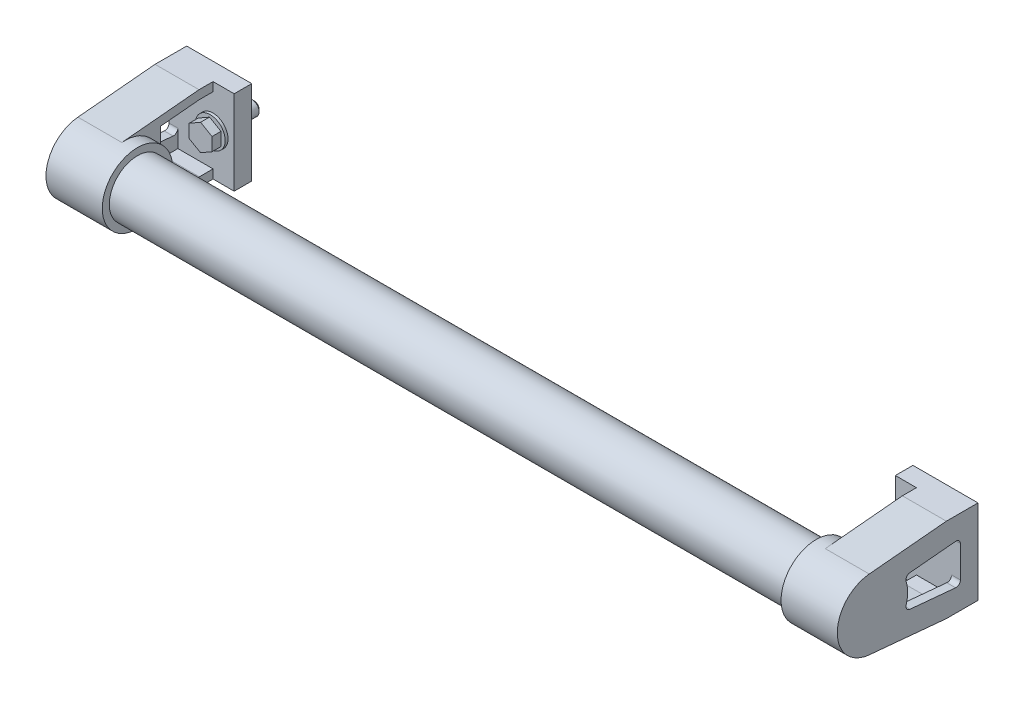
ISO-10303-21;
HEADER;
FILE_DESCRIPTION(('STEP AP214'),'2;1');
FILE_NAME('part.step','',(''),(''),'','','');
FILE_SCHEMA(('AUTOMOTIVE_DESIGN { 1 0 10303 214 1 1 1 1 }'));
ENDSEC;
DATA;
#1=APPLICATION_CONTEXT('core data for automotive mechanical design processes');
#2=APPLICATION_PROTOCOL_DEFINITION('international standard','automotive_design',2000,#1);
#3=PRODUCT_CONTEXT('',#1,'mechanical');
#4=PRODUCT('Part','Part','',(#3));
#5=PRODUCT_RELATED_PRODUCT_CATEGORY('part','',(#4));
#6=PRODUCT_DEFINITION_FORMATION('','',#4);
#7=PRODUCT_DEFINITION_CONTEXT('part definition',#1,'design');
#8=PRODUCT_DEFINITION('design','',#6,#7);
#9=PRODUCT_DEFINITION_SHAPE('','',#8);
#10=(LENGTH_UNIT() NAMED_UNIT(*) SI_UNIT(.MILLI.,.METRE.));
#11=(NAMED_UNIT(*) PLANE_ANGLE_UNIT() SI_UNIT($,.RADIAN.));
#12=(NAMED_UNIT(*) SI_UNIT($,.STERADIAN.) SOLID_ANGLE_UNIT());
#13=UNCERTAINTY_MEASURE_WITH_UNIT(LENGTH_MEASURE(1.E-05),#10,'distance_accuracy_value','');
#14=(GEOMETRIC_REPRESENTATION_CONTEXT(3) GLOBAL_UNCERTAINTY_ASSIGNED_CONTEXT((#13)) GLOBAL_UNIT_ASSIGNED_CONTEXT((#10,
#11,#12)) REPRESENTATION_CONTEXT('',''));
#15=CARTESIAN_POINT('',(0.,0.,0.));
#16=DIRECTION('',(0.,0.,1.));
#17=DIRECTION('',(1.,0.,0.));
#18=AXIS2_PLACEMENT_3D('',#15,#16,#17);
#19=CARTESIAN_POINT('',(16.,-23.9999999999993,18.0000000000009));
#20=DIRECTION('',(0.,0.995687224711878,-0.0927736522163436));
#21=DIRECTION('',(0.,0.0927736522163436,0.995687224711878));
#22=AXIS2_PLACEMENT_3D('',#19,#20,#21);
#23=PLANE('',#22);
#24=DIRECTION('',(0.,0.0927736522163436,0.995687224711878));
#25=VECTOR('',#24,1.);
#26=CARTESIAN_POINT('',(0.,-23.9999999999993,18.0000000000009));
#27=LINE('',#26,#25);
#28=CARTESIAN_POINT('',(0.,-19.9137444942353,61.8554730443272));
#29=VERTEX_POINT('',#28);
#30=CARTESIAN_POINT('',(0.,-23.9999999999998,17.999999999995));
#31=VERTEX_POINT('',#30);
#32=EDGE_CURVE('E1102',#29,#31,#27,.F.);
#33=ORIENTED_EDGE('',*,*,#32,.F.);
#34=DIRECTION('',(-1.,0.,0.));
#35=VECTOR('',#34,1.);
#36=CARTESIAN_POINT('',(7.,-19.9137444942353,61.8554730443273));
#37=LINE('',#36,#35);
#38=CARTESIAN_POINT('',(-25.,-19.9137444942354,61.8554730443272));
#39=VERTEX_POINT('',#38);
#40=EDGE_CURVE('E1038',#39,#29,#37,.F.);
#41=ORIENTED_EDGE('',*,*,#40,.F.);
#42=DIRECTION('',(0.,0.0927736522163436,0.995687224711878));
#43=VECTOR('',#42,1.);
#44=CARTESIAN_POINT('',(-25.,-23.9999999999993,18.0000000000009));
#45=LINE('',#44,#43);
#46=CARTESIAN_POINT('',(-25.,-24.,17.999999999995));
#47=VERTEX_POINT('',#46);
#48=EDGE_CURVE('E1041',#47,#39,#45,.T.);
#49=ORIENTED_EDGE('',*,*,#48,.F.);
#50=DIRECTION('',(1.,0.,0.));
#51=VECTOR('',#50,1.);
#52=CARTESIAN_POINT('',(16.,-24.,17.999999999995));
#53=LINE('',#52,#51);
#54=EDGE_CURVE('E1092',#31,#47,#53,.F.);
#55=ORIENTED_EDGE('',*,*,#54,.F.);
#56=EDGE_LOOP('',(#33,#41,#49,#55));
#57=FACE_BOUND('',#56,.T.);
#58=ADVANCED_FACE('F14',(#57),#23,.F.);
#59=CARTESIAN_POINT('',(16.,24.0000000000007,17.999999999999));
#60=DIRECTION('',(0.,0.995687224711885,0.092773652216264));
#61=DIRECTION('',(0.,-0.092773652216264,0.995687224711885));
#62=AXIS2_PLACEMENT_3D('',#59,#60,#61);
#63=PLANE('',#62);
#64=DIRECTION('',(1.,0.,0.));
#65=VECTOR('',#64,1.);
#66=CARTESIAN_POINT('',(16.,19.9137444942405,61.8554730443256));
#67=LINE('',#66,#65);
#68=CARTESIAN_POINT('',(-25.,19.9137444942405,61.8554730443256));
#69=VERTEX_POINT('',#68);
#70=CARTESIAN_POINT('',(0.,19.9137444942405,61.8554730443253));
#71=VERTEX_POINT('',#70);
#72=EDGE_CURVE('E1033',#69,#71,#67,.T.);
#73=ORIENTED_EDGE('',*,*,#72,.T.);
#74=DIRECTION('',(0.,-0.092773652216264,0.995687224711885));
#75=VECTOR('',#74,1.);
#76=CARTESIAN_POINT('',(0.,24.0000000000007,17.999999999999));
#77=LINE('',#76,#75);
#78=CARTESIAN_POINT('',(0.,24.0000000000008,17.999999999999));
#79=VERTEX_POINT('',#78);
#80=EDGE_CURVE('E1070',#71,#79,#77,.F.);
#81=ORIENTED_EDGE('',*,*,#80,.T.);
#82=DIRECTION('',(1.,0.,0.));
#83=VECTOR('',#82,1.);
#84=CARTESIAN_POINT('',(16.,24.0000000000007,17.999999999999));
#85=LINE('',#84,#83);
#86=CARTESIAN_POINT('',(-25.,24.0000000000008,17.999999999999));
#87=VERTEX_POINT('',#86);
#88=EDGE_CURVE('E1044',#79,#87,#85,.F.);
#89=ORIENTED_EDGE('',*,*,#88,.T.);
#90=DIRECTION('',(0.,-0.092773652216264,0.995687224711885));
#91=VECTOR('',#90,1.);
#92=CARTESIAN_POINT('',(-25.,24.0000000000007,17.999999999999));
#93=LINE('',#92,#91);
#94=EDGE_CURVE('E1037',#87,#69,#93,.T.);
#95=ORIENTED_EDGE('',*,*,#94,.T.);
#96=EDGE_LOOP('',(#73,#81,#89,#95));
#97=FACE_BOUND('',#96,.T.);
#98=ADVANCED_FACE('F931',(#97),#63,.T.);
#99=CARTESIAN_POINT('',(7.,2.62290189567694E-12,60.));
#100=DIRECTION('',(-1.,0.,0.));
#101=DIRECTION('',(0.,0.,1.));
#102=AXIS2_PLACEMENT_3D('',#99,#100,#101);
#103=PLANE('',#102);
#104=CARTESIAN_POINT('',(7.,2.62463661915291E-12,60.));
#105=DIRECTION('',(1.,0.,0.));
#106=DIRECTION('',(0.,0.,-1.));
#107=AXIS2_PLACEMENT_3D('',#104,#105,#106);
#108=CIRCLE('',#107,16.);
#109=CARTESIAN_POINT('',(7.,2.62463661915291E-12,44.));
#110=VERTEX_POINT('',#109);
#111=EDGE_CURVE('E9',#110,#110,#108,.T.);
#112=ORIENTED_EDGE('',*,*,#111,.F.);
#113=EDGE_LOOP('',(#112));
#114=FACE_BOUND('',#113,.T.);
#115=CARTESIAN_POINT('',(7.,2.62290189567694E-12,60.));
#116=DIRECTION('',(-1.,0.,0.));
#117=DIRECTION('',(0.,0.,1.));
#118=AXIS2_PLACEMENT_3D('',#115,#116,#117);
#119=CIRCLE('',#118,20.0000000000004);
#120=CARTESIAN_POINT('',(7.,2.62290189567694E-12,80.0000000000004));
#121=VERTEX_POINT('',#120);
#122=EDGE_CURVE('E1036',#121,#121,#119,.T.);
#123=ORIENTED_EDGE('',*,*,#122,.F.);
#124=EDGE_LOOP('',(#123));
#125=FACE_BOUND('',#124,.T.);
#126=ADVANCED_FACE('F819',(#114,#125),#103,.F.);
#127=CARTESIAN_POINT('',(-6.5,4.9960036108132E-13,12.));
#128=DIRECTION('',(0.,0.,-1.));
#129=DIRECTION('',(0.,1.,0.));
#130=AXIS2_PLACEMENT_3D('',#127,#128,#129);
#131=PLANE('',#130);
#132=CARTESIAN_POINT('',(0.,4.99600361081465E-13,12.));
#133=DIRECTION('',(0.,0.,1.));
#134=DIRECTION('',(0.,-1.,0.));
#135=AXIS2_PLACEMENT_3D('',#132,#133,#134);
#136=CIRCLE('',#135,5.85000000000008);
#137=CARTESIAN_POINT('',(0.,-5.84999999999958,12.0000000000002));
#138=VERTEX_POINT('',#137);
#139=EDGE_CURVE('E992',#138,#138,#136,.F.);
#140=ORIENTED_EDGE('',*,*,#139,.F.);
#141=EDGE_LOOP('',(#140));
#142=FACE_BOUND('',#141,.T.);
#143=DIRECTION('',(0.866025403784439,0.5,0.));
#144=VECTOR('',#143,1.);
#145=CARTESIAN_POINT('',(0.,-7.50555349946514,12.));
#146=LINE('',#145,#144);
#147=CARTESIAN_POINT('',(0.,-7.50555349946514,12.));
#148=VERTEX_POINT('',#147);
#149=CARTESIAN_POINT('',(6.5,-3.75277674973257,12.));
#150=VERTEX_POINT('',#149);
#151=EDGE_CURVE('E985',#148,#150,#146,.T.);
#152=ORIENTED_EDGE('',*,*,#151,.F.);
#153=DIRECTION('',(0.866025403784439,-0.5,0.));
#154=VECTOR('',#153,1.);
#155=CARTESIAN_POINT('',(-6.5,-3.75277674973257,12.));
#156=LINE('',#155,#154);
#157=CARTESIAN_POINT('',(-6.5,-3.75277674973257,12.));
#158=VERTEX_POINT('',#157);
#159=EDGE_CURVE('E1007',#158,#148,#156,.T.);
#160=ORIENTED_EDGE('',*,*,#159,.F.);
#161=DIRECTION('',(0.,-1.,0.));
#162=VECTOR('',#161,1.);
#163=CARTESIAN_POINT('',(-6.5,3.75277674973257,12.));
#164=LINE('',#163,#162);
#165=CARTESIAN_POINT('',(-6.5,3.75277674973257,12.));
#166=VERTEX_POINT('',#165);
#167=EDGE_CURVE('E1000',#166,#158,#164,.T.);
#168=ORIENTED_EDGE('',*,*,#167,.F.);
#169=DIRECTION('',(-0.866025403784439,-0.5,0.));
#170=VECTOR('',#169,1.);
#171=CARTESIAN_POINT('',(0.,7.50555349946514,12.));
#172=LINE('',#171,#170);
#173=CARTESIAN_POINT('',(0.,7.50555349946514,12.));
#174=VERTEX_POINT('',#173);
#175=EDGE_CURVE('E997',#174,#166,#172,.T.);
#176=ORIENTED_EDGE('',*,*,#175,.F.);
#177=DIRECTION('',(-0.866025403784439,0.5,0.));
#178=VECTOR('',#177,1.);
#179=CARTESIAN_POINT('',(6.5,3.75277674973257,12.));
#180=LINE('',#179,#178);
#181=CARTESIAN_POINT('',(6.5,3.75277674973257,12.));
#182=VERTEX_POINT('',#181);
#183=EDGE_CURVE('E990',#182,#174,#180,.T.);
#184=ORIENTED_EDGE('',*,*,#183,.F.);
#185=DIRECTION('',(0.,1.,0.));
#186=VECTOR('',#185,1.);
#187=CARTESIAN_POINT('',(6.5,-3.75277674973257,12.));
#188=LINE('',#187,#186);
#189=EDGE_CURVE('E971',#150,#182,#188,.T.);
#190=ORIENTED_EDGE('',*,*,#189,.F.);
#191=EDGE_LOOP('',(#152,#160,#168,#176,#184,#190));
#192=FACE_BOUND('',#191,.T.);
#193=ADVANCED_FACE('F815',(#142,#192),#131,.T.);
#194=CARTESIAN_POINT('',(0.,3.33066907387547E-12,80.));
#195=DIRECTION('',(0.,0.,1.));
#196=DIRECTION('',(0.,-1.,0.));
#197=AXIS2_PLACEMENT_3D('',#194,#195,#196);
#198=CYLINDRICAL_SURFACE('',#197,5.85000000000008);
#199=ORIENTED_EDGE('',*,*,#139,.T.);
#200=EDGE_LOOP('',(#199));
#201=FACE_BOUND('',#200,.T.);
#202=CARTESIAN_POINT('',(0.,4.82947015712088E-13,11.6));
#203=DIRECTION('',(0.,0.,1.));
#204=DIRECTION('',(0.,-1.,0.));
#205=AXIS2_PLACEMENT_3D('',#202,#203,#204);
#206=CIRCLE('',#205,5.85000000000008);
#207=CARTESIAN_POINT('',(0.,-5.8499999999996,11.6000000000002));
#208=VERTEX_POINT('',#207);
#209=EDGE_CURVE('E1331',#208,#208,#206,.F.);
#210=ORIENTED_EDGE('',*,*,#209,.F.);
#211=EDGE_LOOP('',(#210));
#212=FACE_BOUND('',#211,.T.);
#213=ADVANCED_FACE('F818',(#201,#212),#198,.T.);
#214=CARTESIAN_POINT('',(-5.85,4.71844785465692E-13,11.6));
#215=DIRECTION('',(0.,0.,1.));
#216=DIRECTION('',(0.,-1.,0.));
#217=AXIS2_PLACEMENT_3D('',#214,#215,#216);
#218=PLANE('',#217);
#219=CARTESIAN_POINT('',(0.,4.82947015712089E-13,11.6));
#220=DIRECTION('',(0.,0.,1.));
#221=DIRECTION('',(0.,-1.,0.));
#222=AXIS2_PLACEMENT_3D('',#219,#220,#221);
#223=CIRCLE('',#222,8.50000000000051);
#224=CARTESIAN_POINT('',(0.,-8.50000000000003,11.6000000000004));
#225=VERTEX_POINT('',#224);
#226=EDGE_CURVE('E1278',#225,#225,#223,.F.);
#227=ORIENTED_EDGE('',*,*,#226,.F.);
#228=EDGE_LOOP('',(#227));
#229=FACE_BOUND('',#228,.T.);
#230=ORIENTED_EDGE('',*,*,#209,.T.);
#231=EDGE_LOOP('',(#230));
#232=FACE_BOUND('',#231,.T.);
#233=ADVANCED_FACE('F827',(#229,#232),#218,.T.);
#234=CARTESIAN_POINT('',(0.,5.27355936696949E-13,12.7319341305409));
#235=DIRECTION('',(0.,0.,1.));
#236=DIRECTION('',(0.,-1.,0.));
#237=AXIS2_PLACEMENT_3D('',#234,#235,#236);
#238=CYLINDRICAL_SURFACE('',#237,3.99999999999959);
#239=CARTESIAN_POINT('',(0.,-5.10644337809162E-13,-12.2));
#240=DIRECTION('',(0.,0.,1.));
#241=DIRECTION('',(0.,-1.,0.));
#242=AXIS2_PLACEMENT_3D('',#239,#240,#241);
#243=CIRCLE('',#242,3.99999999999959);
#244=CARTESIAN_POINT('',(0.,-4.0000000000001,-12.1999999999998));
#245=VERTEX_POINT('',#244);
#246=EDGE_CURVE('E1302',#245,#245,#243,.T.);
#247=ORIENTED_EDGE('',*,*,#246,.T.);
#248=EDGE_LOOP('',(#247));
#249=FACE_BOUND('',#248,.T.);
#250=CARTESIAN_POINT('',(0.,0.,0.));
#251=DIRECTION('',(0.,0.,1.));
#252=DIRECTION('',(0.,-1.,0.));
#253=AXIS2_PLACEMENT_3D('',#250,#251,#252);
#254=CIRCLE('',#253,3.99999999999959);
#255=CARTESIAN_POINT('',(0.,-3.99999999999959,1.1102230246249E-13));
#256=VERTEX_POINT('',#255);
#257=EDGE_CURVE('E1173',#256,#256,#254,.T.);
#258=ORIENTED_EDGE('',*,*,#257,.F.);
#259=EDGE_LOOP('',(#258));
#260=FACE_BOUND('',#259,.T.);
#261=ADVANCED_FACE('F831',(#249,#260),#238,.T.);
#262=CARTESIAN_POINT('',(0.,3.33066907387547E-12,80.));
#263=DIRECTION('',(0.,0.,1.));
#264=DIRECTION('',(0.,-1.,0.));
#265=AXIS2_PLACEMENT_3D('',#262,#263,#264);
#266=CYLINDRICAL_SURFACE('',#265,8.50000000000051);
#267=ORIENTED_EDGE('',*,*,#226,.T.);
#268=EDGE_LOOP('',(#267));
#269=FACE_BOUND('',#268,.T.);
#270=CARTESIAN_POINT('',(0.,4.16333634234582E-13,10.));
#271=DIRECTION('',(0.,0.,1.));
#272=DIRECTION('',(0.,-1.,0.));
#273=AXIS2_PLACEMENT_3D('',#270,#271,#272);
#274=CIRCLE('',#273,8.50000000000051);
#275=CARTESIAN_POINT('',(0.,-8.50000000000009,10.0000000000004));
#276=VERTEX_POINT('',#275);
#277=EDGE_CURVE('E1139',#276,#276,#274,.T.);
#278=ORIENTED_EDGE('',*,*,#277,.T.);
#279=EDGE_LOOP('',(#278));
#280=FACE_BOUND('',#279,.T.);
#281=ADVANCED_FACE('F835',(#269,#280),#266,.T.);
#282=CARTESIAN_POINT('',(-20.,-18.9999999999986,40.0000000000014));
#283=DIRECTION('',(1.,0.,0.));
#284=DIRECTION('',(0.,0.,-1.));
#285=AXIS2_PLACEMENT_3D('',#282,#283,#284);
#286=PLANE('',#285);
#287=DIRECTION('',(0.,1.,0.));
#288=VECTOR('',#287,1.);
#289=CARTESIAN_POINT('',(-20.,-23.9999999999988,40.0000000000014));
#290=LINE('',#289,#288);
#291=CARTESIAN_POINT('',(-20.,-16.9284817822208,40.0000000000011));
#292=VERTEX_POINT('',#291);
#293=CARTESIAN_POINT('',(-20.,-8.50076165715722,40.0000000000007));
#294=VERTEX_POINT('',#293);
#295=EDGE_CURVE('E1243',#292,#294,#290,.T.);
#296=ORIENTED_EDGE('',*,*,#295,.F.);
#297=DIRECTION('',(0.,-0.0927736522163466,-0.995687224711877));
#298=VECTOR('',#297,1.);
#299=CARTESIAN_POINT('',(-20.,-18.9999999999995,17.7675646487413));
#300=LINE('',#299,#298);
#301=CARTESIAN_POINT('',(-20.,-18.9999999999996,17.7675646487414));
#302=VERTEX_POINT('',#301);
#303=EDGE_CURVE('E1253',#292,#302,#300,.T.);
#304=ORIENTED_EDGE('',*,*,#303,.T.);
#305=DIRECTION('',(0.,0.,-1.));
#306=VECTOR('',#305,1.);
#307=CARTESIAN_POINT('',(-20.,-19.,10.0000000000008));
#308=LINE('',#307,#306);
#309=CARTESIAN_POINT('',(-20.,-19.,10.0000000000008));
#310=VERTEX_POINT('',#309);
#311=EDGE_CURVE('E1275',#302,#310,#308,.T.);
#312=ORIENTED_EDGE('',*,*,#311,.T.);
#313=DIRECTION('',(0.,1.,0.));
#314=VECTOR('',#313,1.);
#315=CARTESIAN_POINT('',(-20.,-8.94532766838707,10.0000000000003));
#316=LINE('',#315,#314);
#317=CARTESIAN_POINT('',(-20.,-8.94532766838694,10.0000000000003));
#318=VERTEX_POINT('',#317);
#319=EDGE_CURVE('E1133',#310,#318,#316,.T.);
#320=ORIENTED_EDGE('',*,*,#319,.T.);
#321=CARTESIAN_POINT('',(-20.,-8.94532766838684,12.5000000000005));
#322=DIRECTION('',(-1.,0.,0.));
#323=DIRECTION('',(0.,0.,1.));
#324=AXIS2_PLACEMENT_3D('',#321,#322,#323);
#325=CIRCLE('',#324,2.5);
#326=CARTESIAN_POINT('',(-20.,-11.4345457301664,12.7319341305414));
#327=VERTEX_POINT('',#326);
#328=EDGE_CURVE('E1140',#318,#327,#325,.T.);
#329=ORIENTED_EDGE('',*,*,#328,.T.);
#330=DIRECTION('',(0.,0.0927736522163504,0.995687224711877));
#331=VECTOR('',#330,1.);
#332=CARTESIAN_POINT('',(-20.,-11.4345457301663,12.7319341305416));
#333=LINE('',#332,#331);
#334=CARTESIAN_POINT('',(-20.,-9.01504355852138,38.6990847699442));
#335=VERTEX_POINT('',#334);
#336=EDGE_CURVE('E1144',#335,#327,#333,.F.);
#337=ORIENTED_EDGE('',*,*,#336,.F.);
#338=CARTESIAN_POINT('',(-20.,-6.52582549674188,38.4671506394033));
#339=DIRECTION('',(-1.,0.,0.));
#340=DIRECTION('',(0.,0.,1.));
#341=AXIS2_PLACEMENT_3D('',#338,#339,#340);
#342=CIRCLE('',#341,2.5);
#343=EDGE_CURVE('E1149',#335,#294,#342,.T.);
#344=ORIENTED_EDGE('',*,*,#343,.T.);
#345=EDGE_LOOP('',(#296,#304,#312,#320,#329,#337,#344));
#346=FACE_BOUND('',#345,.T.);
#347=ADVANCED_FACE('F839',(#346),#286,.T.);
#348=CARTESIAN_POINT('',(-20.,-18.9999999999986,40.0000000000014));
#349=DIRECTION('',(1.,0.,0.));
#350=DIRECTION('',(0.,0.,-1.));
#351=AXIS2_PLACEMENT_3D('',#348,#349,#350);
#352=PLANE('',#351);
#353=DIRECTION('',(0.,1.,0.));
#354=VECTOR('',#353,1.);
#355=CARTESIAN_POINT('',(-20.,-8.94532766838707,10.0000000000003));
#356=LINE('',#355,#354);
#357=CARTESIAN_POINT('',(-20.,8.94532766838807,9.99999999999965));
#358=VERTEX_POINT('',#357);
#359=CARTESIAN_POINT('',(-20.,19.0000000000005,9.99999999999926));
#360=VERTEX_POINT('',#359);
#361=EDGE_CURVE('E1136',#358,#360,#356,.T.);
#362=ORIENTED_EDGE('',*,*,#361,.T.);
#363=DIRECTION('',(0.,0.,-1.));
#364=VECTOR('',#363,1.);
#365=CARTESIAN_POINT('',(-20.,19.0000000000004,9.99999999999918));
#366=LINE('',#365,#364);
#367=CARTESIAN_POINT('',(-20.,19.0000000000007,17.7675646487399));
#368=VERTEX_POINT('',#367);
#369=EDGE_CURVE('E1211',#368,#360,#366,.T.);
#370=ORIENTED_EDGE('',*,*,#369,.F.);
#371=DIRECTION('',(0.,0.0927736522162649,-0.995687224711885));
#372=VECTOR('',#371,1.);
#373=CARTESIAN_POINT('',(-20.,19.0000000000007,17.7675646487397));
#374=LINE('',#373,#372);
#375=CARTESIAN_POINT('',(-20.,16.9284817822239,40.));
#376=VERTEX_POINT('',#375);
#377=EDGE_CURVE('E1212',#376,#368,#374,.T.);
#378=ORIENTED_EDGE('',*,*,#377,.F.);
#379=DIRECTION('',(0.,1.,0.));
#380=VECTOR('',#379,1.);
#381=CARTESIAN_POINT('',(-20.,-23.9999999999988,40.0000000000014));
#382=LINE('',#381,#380);
#383=CARTESIAN_POINT('',(-20.,8.50076165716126,40.));
#384=VERTEX_POINT('',#383);
#385=EDGE_CURVE('E1222',#384,#376,#382,.T.);
#386=ORIENTED_EDGE('',*,*,#385,.F.);
#387=CARTESIAN_POINT('',(-20.,6.52582549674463,38.4671506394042));
#388=DIRECTION('',(-1.,0.,0.));
#389=DIRECTION('',(0.,0.,1.));
#390=AXIS2_PLACEMENT_3D('',#387,#388,#389);
#391=CIRCLE('',#390,2.5);
#392=CARTESIAN_POINT('',(-20.,9.01504355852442,38.699084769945));
#393=VERTEX_POINT('',#392);
#394=EDGE_CURVE('E1150',#384,#393,#391,.T.);
#395=ORIENTED_EDGE('',*,*,#394,.T.);
#396=DIRECTION('',(0.,-0.0927736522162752,0.995687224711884));
#397=VECTOR('',#396,1.);
#398=CARTESIAN_POINT('',(-20.,11.4345457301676,12.7319341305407));
#399=LINE('',#398,#397);
#400=CARTESIAN_POINT('',(-20.,11.4345457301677,12.7319341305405));
#401=VERTEX_POINT('',#400);
#402=EDGE_CURVE('E1154',#393,#401,#399,.F.);
#403=ORIENTED_EDGE('',*,*,#402,.T.);
#404=CARTESIAN_POINT('',(-20.,8.94532766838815,12.4999999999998));
#405=DIRECTION('',(-1.,0.,0.));
#406=DIRECTION('',(0.,0.,1.));
#407=AXIS2_PLACEMENT_3D('',#404,#405,#406);
#408=CIRCLE('',#407,2.5);
#409=EDGE_CURVE('E1172',#401,#358,#408,.T.);
#410=ORIENTED_EDGE('',*,*,#409,.T.);
#411=EDGE_LOOP('',(#362,#370,#378,#386,#395,#403,#410));
#412=FACE_BOUND('',#411,.T.);
#413=ADVANCED_FACE('F843',(#412),#352,.T.);
#414=CARTESIAN_POINT('',(-11.,-19.,10.0000000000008));
#415=DIRECTION('',(0.,-1.,0.));
#416=DIRECTION('',(0.,0.,-1.));
#417=AXIS2_PLACEMENT_3D('',#414,#415,#416);
#418=PLANE('',#417);
#419=ORIENTED_EDGE('',*,*,#311,.F.);
#420=DIRECTION('',(1.,0.,0.));
#421=VECTOR('',#420,1.);
#422=CARTESIAN_POINT('',(-11.,-18.9999999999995,17.7675646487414));
#423=LINE('',#422,#421);
#424=CARTESIAN_POINT('',(0.,-19.,17.7675646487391));
#425=VERTEX_POINT('',#424);
#426=EDGE_CURVE('E1244',#302,#425,#423,.T.);
#427=ORIENTED_EDGE('',*,*,#426,.T.);
#428=DIRECTION('',(0.,0.,-1.));
#429=VECTOR('',#428,1.);
#430=CARTESIAN_POINT('',(0.,-19.,38.4671506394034));
#431=LINE('',#430,#429);
#432=CARTESIAN_POINT('',(0.,-19.,10.0000000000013));
#433=VERTEX_POINT('',#432);
#434=EDGE_CURVE('E1227',#433,#425,#431,.F.);
#435=ORIENTED_EDGE('',*,*,#434,.F.);
#436=DIRECTION('',(1.,0.,0.));
#437=VECTOR('',#436,1.);
#438=CARTESIAN_POINT('',(16.,-19.,10.0000000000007));
#439=LINE('',#438,#437);
#440=EDGE_CURVE('E1187',#433,#310,#439,.F.);
#441=ORIENTED_EDGE('',*,*,#440,.T.);
#442=EDGE_LOOP('',(#419,#427,#435,#441));
#443=FACE_BOUND('',#442,.T.);
#444=ADVANCED_FACE('F847',(#443),#418,.F.);
#445=CARTESIAN_POINT('',(-11.,-18.9999999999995,17.7675646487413));
#446=DIRECTION('',(0.,-0.995687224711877,0.0927736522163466));
#447=DIRECTION('',(0.,-0.0927736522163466,-0.995687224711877));
#448=AXIS2_PLACEMENT_3D('',#445,#446,#447);
#449=PLANE('',#448);
#450=ORIENTED_EDGE('',*,*,#303,.F.);
#451=DIRECTION('',(1.,0.,0.));
#452=VECTOR('',#451,1.);
#453=CARTESIAN_POINT('',(3.99999999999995,-16.9284817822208,40.0000000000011));
#454=LINE('',#453,#452);
#455=CARTESIAN_POINT('',(0.,-16.9284817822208,40.0000000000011));
#456=VERTEX_POINT('',#455);
#457=EDGE_CURVE('E1240',#456,#292,#454,.F.);
#458=ORIENTED_EDGE('',*,*,#457,.F.);
#459=DIRECTION('',(0.,0.0927736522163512,0.995687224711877));
#460=VECTOR('',#459,1.);
#461=CARTESIAN_POINT('',(0.,-18.9999999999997,17.7675646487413));
#462=LINE('',#461,#460);
#463=EDGE_CURVE('E1120',#425,#456,#462,.T.);
#464=ORIENTED_EDGE('',*,*,#463,.F.);
#465=ORIENTED_EDGE('',*,*,#426,.F.);
#466=EDGE_LOOP('',(#450,#458,#464,#465));
#467=FACE_BOUND('',#466,.T.);
#468=ADVANCED_FACE('F851',(#467),#449,.F.);
#469=CARTESIAN_POINT('',(3.99999999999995,-23.9999999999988,40.0000000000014));
#470=DIRECTION('',(0.,0.,-1.));
#471=DIRECTION('',(0.,1.,0.));
#472=AXIS2_PLACEMENT_3D('',#469,#470,#471);
#473=PLANE('',#472);
#474=ORIENTED_EDGE('',*,*,#457,.T.);
#475=ORIENTED_EDGE('',*,*,#295,.T.);
#476=DIRECTION('',(-1.,0.,0.));
#477=VECTOR('',#476,1.);
#478=CARTESIAN_POINT('',(16.,-8.50076165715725,40.0000000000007));
#479=LINE('',#478,#477);
#480=CARTESIAN_POINT('',(0.,-8.50076165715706,40.0000000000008));
#481=VERTEX_POINT('',#480);
#482=EDGE_CURVE('E1145',#294,#481,#479,.F.);
#483=ORIENTED_EDGE('',*,*,#482,.T.);
#484=DIRECTION('',(0.,1.,0.));
#485=VECTOR('',#484,1.);
#486=CARTESIAN_POINT('',(0.,-6.52582549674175,40.0000000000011));
#487=LINE('',#486,#485);
#488=EDGE_CURVE('E1116',#456,#481,#487,.T.);
#489=ORIENTED_EDGE('',*,*,#488,.F.);
#490=EDGE_LOOP('',(#474,#475,#483,#489));
#491=FACE_BOUND('',#490,.T.);
#492=ADVANCED_FACE('F855',(#491),#473,.T.);
#493=CARTESIAN_POINT('',(3.99999999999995,-23.9999999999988,40.0000000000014));
#494=DIRECTION('',(0.,0.,-1.));
#495=DIRECTION('',(0.,1.,0.));
#496=AXIS2_PLACEMENT_3D('',#493,#494,#495);
#497=PLANE('',#496);
#498=DIRECTION('',(-1.,0.,0.));
#499=VECTOR('',#498,1.);
#500=CARTESIAN_POINT('',(16.,8.50076165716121,40.));
#501=LINE('',#500,#499);
#502=CARTESIAN_POINT('',(0.,8.50076165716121,40.));
#503=VERTEX_POINT('',#502);
#504=EDGE_CURVE('E1153',#503,#384,#501,.T.);
#505=ORIENTED_EDGE('',*,*,#504,.T.);
#506=ORIENTED_EDGE('',*,*,#385,.T.);
#507=DIRECTION('',(1.,0.,0.));
#508=VECTOR('',#507,1.);
#509=CARTESIAN_POINT('',(-11.,16.9284817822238,40.));
#510=LINE('',#509,#508);
#511=CARTESIAN_POINT('',(0.,16.9284817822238,40.));
#512=VERTEX_POINT('',#511);
#513=EDGE_CURVE('E1219',#512,#376,#510,.F.);
#514=ORIENTED_EDGE('',*,*,#513,.F.);
#515=DIRECTION('',(0.,1.,0.));
#516=VECTOR('',#515,1.);
#517=CARTESIAN_POINT('',(0.,2.62290189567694E-12,40.));
#518=LINE('',#517,#516);
#519=EDGE_CURVE('E1084',#503,#512,#518,.T.);
#520=ORIENTED_EDGE('',*,*,#519,.F.);
#521=EDGE_LOOP('',(#505,#506,#514,#520));
#522=FACE_BOUND('',#521,.T.);
#523=ADVANCED_FACE('F859',(#522),#497,.T.);
#524=CARTESIAN_POINT('',(-11.,19.0000000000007,17.7675646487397));
#525=DIRECTION('',(0.,-0.995687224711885,-0.0927736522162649));
#526=DIRECTION('',(0.,0.0927736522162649,-0.995687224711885));
#527=AXIS2_PLACEMENT_3D('',#524,#525,#526);
#528=PLANE('',#527);
#529=DIRECTION('',(1.,0.,0.));
#530=VECTOR('',#529,1.);
#531=CARTESIAN_POINT('',(-11.,19.0000000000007,17.7675646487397));
#532=LINE('',#531,#530);
#533=CARTESIAN_POINT('',(0.,19.0000000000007,17.7675646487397));
#534=VERTEX_POINT('',#533);
#535=EDGE_CURVE('E1208',#534,#368,#532,.F.);
#536=ORIENTED_EDGE('',*,*,#535,.F.);
#537=DIRECTION('',(0.,0.0927736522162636,-0.995687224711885));
#538=VECTOR('',#537,1.);
#539=CARTESIAN_POINT('',(0.,16.9284817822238,40.));
#540=LINE('',#539,#538);
#541=EDGE_CURVE('E1087',#512,#534,#540,.T.);
#542=ORIENTED_EDGE('',*,*,#541,.F.);
#543=ORIENTED_EDGE('',*,*,#513,.T.);
#544=ORIENTED_EDGE('',*,*,#377,.T.);
#545=EDGE_LOOP('',(#536,#542,#543,#544));
#546=FACE_BOUND('',#545,.T.);
#547=ADVANCED_FACE('F863',(#546),#528,.T.);
#548=CARTESIAN_POINT('',(-11.,19.0000000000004,9.99999999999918));
#549=DIRECTION('',(0.,-1.,0.));
#550=DIRECTION('',(0.,0.,-1.));
#551=AXIS2_PLACEMENT_3D('',#548,#549,#550);
#552=PLANE('',#551);
#553=DIRECTION('',(1.,0.,0.));
#554=VECTOR('',#553,1.);
#555=CARTESIAN_POINT('',(16.,19.0000000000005,9.99999999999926));
#556=LINE('',#555,#554);
#557=CARTESIAN_POINT('',(0.,19.0000000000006,9.99999999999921));
#558=VERTEX_POINT('',#557);
#559=EDGE_CURVE('E1198',#360,#558,#556,.T.);
#560=ORIENTED_EDGE('',*,*,#559,.T.);
#561=DIRECTION('',(0.,0.,-1.));
#562=VECTOR('',#561,1.);
#563=CARTESIAN_POINT('',(0.,19.0000000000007,60.));
#564=LINE('',#563,#562);
#565=EDGE_CURVE('E1193',#534,#558,#564,.T.);
#566=ORIENTED_EDGE('',*,*,#565,.F.);
#567=ORIENTED_EDGE('',*,*,#535,.T.);
#568=ORIENTED_EDGE('',*,*,#369,.T.);
#569=EDGE_LOOP('',(#560,#566,#567,#568));
#570=FACE_BOUND('',#569,.T.);
#571=ADVANCED_FACE('F867',(#570),#552,.T.);
#572=CARTESIAN_POINT('',(12.,-24.,10.0000000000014));
#573=DIRECTION('',(1.,0.,0.));
#574=DIRECTION('',(0.,0.,-1.));
#575=AXIS2_PLACEMENT_3D('',#572,#573,#574);
#576=PLANE('',#575);
#577=DIRECTION('',(0.,1.,0.));
#578=VECTOR('',#577,1.);
#579=CARTESIAN_POINT('',(12.,-24.0000000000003,9.43689570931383E-13));
#580=LINE('',#579,#578);
#581=CARTESIAN_POINT('',(12.,24.,-1.0177044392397E-12));
#582=VERTEX_POINT('',#581);
#583=CARTESIAN_POINT('',(12.,-24.0000000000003,9.43689570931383E-13));
#584=VERTEX_POINT('',#583);
#585=EDGE_CURVE('E1169',#582,#584,#580,.F.);
#586=ORIENTED_EDGE('',*,*,#585,.F.);
#587=DIRECTION('',(0.,0.,1.));
#588=VECTOR('',#587,1.);
#589=CARTESIAN_POINT('',(12.,24.,-1.0547118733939E-12));
#590=LINE('',#589,#588);
#591=CARTESIAN_POINT('',(12.,24.0000000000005,9.99999999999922));
#592=VERTEX_POINT('',#591);
#593=EDGE_CURVE('E1157',#592,#582,#590,.F.);
#594=ORIENTED_EDGE('',*,*,#593,.F.);
#595=DIRECTION('',(0.,1.,0.));
#596=VECTOR('',#595,1.);
#597=CARTESIAN_POINT('',(12.,-8.94532766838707,10.0000000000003));
#598=LINE('',#597,#596);
#599=CARTESIAN_POINT('',(12.,-24.,10.0000000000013));
#600=VERTEX_POINT('',#599);
#601=EDGE_CURVE('E1184',#592,#600,#598,.F.);
#602=ORIENTED_EDGE('',*,*,#601,.T.);
#603=DIRECTION('',(0.,0.,1.));
#604=VECTOR('',#603,1.);
#605=CARTESIAN_POINT('',(12.,-24.0000000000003,9.43689570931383E-13));
#606=LINE('',#605,#604);
#607=EDGE_CURVE('E1166',#600,#584,#606,.F.);
#608=ORIENTED_EDGE('',*,*,#607,.T.);
#609=EDGE_LOOP('',(#586,#594,#602,#608));
#610=FACE_BOUND('',#609,.T.);
#611=ADVANCED_FACE('F871',(#610),#576,.T.);
#612=CARTESIAN_POINT('',(16.,-24.0000000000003,9.43689570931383E-13));
#613=DIRECTION('',(0.,0.,-1.));
#614=DIRECTION('',(0.,1.,0.));
#615=AXIS2_PLACEMENT_3D('',#612,#613,#614);
#616=PLANE('',#615);
#617=DIRECTION('',(1.,0.,0.));
#618=VECTOR('',#617,1.);
#619=CARTESIAN_POINT('',(16.,-24.0000000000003,9.43689570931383E-13));
#620=LINE('',#619,#618);
#621=CARTESIAN_POINT('',(-25.,-24.0000000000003,-3.88578058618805E-13));
#622=VERTEX_POINT('',#621);
#623=EDGE_CURVE('E1108',#584,#622,#620,.F.);
#624=ORIENTED_EDGE('',*,*,#623,.T.);
#625=DIRECTION('',(0.,1.,0.));
#626=VECTOR('',#625,1.);
#627=CARTESIAN_POINT('',(-25.,2.62290189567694E-12,-1.0547118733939E-12));
#628=LINE('',#627,#626);
#629=CARTESIAN_POINT('',(-25.,24.0000000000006,-1.0547118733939E-12));
#630=VERTEX_POINT('',#629);
#631=EDGE_CURVE('E1064',#630,#622,#628,.F.);
#632=ORIENTED_EDGE('',*,*,#631,.F.);
#633=DIRECTION('',(1.,0.,0.));
#634=VECTOR('',#633,1.);
#635=CARTESIAN_POINT('',(16.,24.,-1.0547118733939E-12));
#636=LINE('',#635,#634);
#637=EDGE_CURVE('E1097',#582,#630,#636,.F.);
#638=ORIENTED_EDGE('',*,*,#637,.F.);
#639=ORIENTED_EDGE('',*,*,#585,.T.);
#640=EDGE_LOOP('',(#624,#632,#638,#639));
#641=FACE_BOUND('',#640,.T.);
#642=ORIENTED_EDGE('',*,*,#257,.T.);
#643=EDGE_LOOP('',(#642));
#644=FACE_BOUND('',#643,.T.);
#645=ADVANCED_FACE('F875',(#641,#644),#616,.T.);
#646=CARTESIAN_POINT('',(7.,8.94532766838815,12.4999999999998));
#647=DIRECTION('',(-1.,0.,0.));
#648=DIRECTION('',(0.,0.,1.));
#649=AXIS2_PLACEMENT_3D('',#646,#647,#648);
#650=CYLINDRICAL_SURFACE('',#649,2.5);
#651=DIRECTION('',(1.,0.,0.));
#652=VECTOR('',#651,1.);
#653=CARTESIAN_POINT('',(7.,11.4345457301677,12.7319341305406));
#654=LINE('',#653,#652);
#655=CARTESIAN_POINT('',(-25.,11.4345457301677,12.7319341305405));
#656=VERTEX_POINT('',#655);
#657=EDGE_CURVE('E1151',#401,#656,#654,.F.);
#658=ORIENTED_EDGE('',*,*,#657,.T.);
#659=CARTESIAN_POINT('',(-25.,8.94532766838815,12.4999999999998));
#660=DIRECTION('',(-1.,0.,0.));
#661=DIRECTION('',(0.,0.,1.));
#662=AXIS2_PLACEMENT_3D('',#659,#660,#661);
#663=CIRCLE('',#662,2.5);
#664=CARTESIAN_POINT('',(-25.,8.94532766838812,10.));
#665=VERTEX_POINT('',#664);
#666=EDGE_CURVE('E1060',#665,#656,#663,.F.);
#667=ORIENTED_EDGE('',*,*,#666,.F.);
#668=DIRECTION('',(1.,0.,0.));
#669=VECTOR('',#668,1.);
#670=CARTESIAN_POINT('',(16.,8.94532766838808,9.99999999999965));
#671=LINE('',#670,#669);
#672=EDGE_CURVE('E1132',#665,#358,#671,.T.);
#673=ORIENTED_EDGE('',*,*,#672,.T.);
#674=ORIENTED_EDGE('',*,*,#409,.F.);
#675=EDGE_LOOP('',(#658,#667,#673,#674));
#676=FACE_BOUND('',#675,.T.);
#677=ADVANCED_FACE('F879',(#676),#650,.F.);
#678=CARTESIAN_POINT('',(7.,11.4345457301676,12.7319341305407));
#679=DIRECTION('',(0.,0.995687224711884,0.0927736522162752));
#680=DIRECTION('',(0.,-0.0927736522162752,0.995687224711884));
#681=AXIS2_PLACEMENT_3D('',#678,#679,#680);
#682=PLANE('',#681);
#683=DIRECTION('',(0.,-0.0927736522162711,0.995687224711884));
#684=VECTOR('',#683,1.);
#685=CARTESIAN_POINT('',(-25.,11.4345457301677,12.7319341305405));
#686=LINE('',#685,#684);
#687=CARTESIAN_POINT('',(-25.,9.01504355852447,38.699084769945));
#688=VERTEX_POINT('',#687);
#689=EDGE_CURVE('E1056',#656,#688,#686,.T.);
#690=ORIENTED_EDGE('',*,*,#689,.F.);
#691=ORIENTED_EDGE('',*,*,#657,.F.);
#692=ORIENTED_EDGE('',*,*,#402,.F.);
#693=DIRECTION('',(-1.,0.,0.));
#694=VECTOR('',#693,1.);
#695=CARTESIAN_POINT('',(16.,9.01504355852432,38.6990847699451));
#696=LINE('',#695,#694);
#697=EDGE_CURVE('E1146',#393,#688,#696,.T.);
#698=ORIENTED_EDGE('',*,*,#697,.T.);
#699=EDGE_LOOP('',(#690,#691,#692,#698));
#700=FACE_BOUND('',#699,.T.);
#701=ADVANCED_FACE('F883',(#700),#682,.F.);
#702=CARTESIAN_POINT('',(7.,-11.4345457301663,12.7319341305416));
#703=DIRECTION('',(0.,0.995687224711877,-0.0927736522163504));
#704=DIRECTION('',(0.,0.0927736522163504,0.995687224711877));
#705=AXIS2_PLACEMENT_3D('',#702,#703,#704);
#706=PLANE('',#705);
#707=DIRECTION('',(-1.,0.,0.));
#708=VECTOR('',#707,1.);
#709=CARTESIAN_POINT('',(7.,-11.4345457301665,12.7319341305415));
#710=LINE('',#709,#708);
#711=CARTESIAN_POINT('',(-25.,-11.4345457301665,12.7319341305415));
#712=VERTEX_POINT('',#711);
#713=EDGE_CURVE('E1137',#327,#712,#710,.T.);
#714=ORIENTED_EDGE('',*,*,#713,.T.);
#715=DIRECTION('',(0.,-0.0927736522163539,-0.995687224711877));
#716=VECTOR('',#715,1.);
#717=CARTESIAN_POINT('',(-25.,-9.01504355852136,38.6990847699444));
#718=LINE('',#717,#716);
#719=CARTESIAN_POINT('',(-25.,-9.01504355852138,38.6990847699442));
#720=VERTEX_POINT('',#719);
#721=EDGE_CURVE('E1052',#720,#712,#718,.T.);
#722=ORIENTED_EDGE('',*,*,#721,.F.);
#723=DIRECTION('',(1.,0.,0.));
#724=VECTOR('',#723,1.);
#725=CARTESIAN_POINT('',(7.,-9.01504355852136,38.6990847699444));
#726=LINE('',#725,#724);
#727=EDGE_CURVE('E1141',#720,#335,#726,.T.);
#728=ORIENTED_EDGE('',*,*,#727,.T.);
#729=ORIENTED_EDGE('',*,*,#336,.T.);
#730=EDGE_LOOP('',(#714,#722,#728,#729));
#731=FACE_BOUND('',#730,.T.);
#732=ADVANCED_FACE('F887',(#731),#706,.T.);
#733=CARTESIAN_POINT('',(7.,-8.94532766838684,12.5000000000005));
#734=DIRECTION('',(-1.,0.,0.));
#735=DIRECTION('',(0.,0.,1.));
#736=AXIS2_PLACEMENT_3D('',#733,#734,#735);
#737=CYLINDRICAL_SURFACE('',#736,2.5);
#738=CARTESIAN_POINT('',(-25.,-8.94532766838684,12.5000000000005));
#739=DIRECTION('',(-1.,0.,0.));
#740=DIRECTION('',(0.,0.,1.));
#741=AXIS2_PLACEMENT_3D('',#738,#739,#740);
#742=CIRCLE('',#741,2.5);
#743=CARTESIAN_POINT('',(-25.,-8.94532766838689,10.0000000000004));
#744=VERTEX_POINT('',#743);
#745=EDGE_CURVE('E1051',#712,#744,#742,.F.);
#746=ORIENTED_EDGE('',*,*,#745,.F.);
#747=ORIENTED_EDGE('',*,*,#713,.F.);
#748=ORIENTED_EDGE('',*,*,#328,.F.);
#749=DIRECTION('',(1.,0.,0.));
#750=VECTOR('',#749,1.);
#751=CARTESIAN_POINT('',(16.,-8.94532766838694,10.0000000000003));
#752=LINE('',#751,#750);
#753=EDGE_CURVE('E1130',#318,#744,#752,.F.);
#754=ORIENTED_EDGE('',*,*,#753,.T.);
#755=EDGE_LOOP('',(#746,#747,#748,#754));
#756=FACE_BOUND('',#755,.T.);
#757=ADVANCED_FACE('F891',(#756),#737,.F.);
#758=CARTESIAN_POINT('',(16.,-8.94532766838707,10.0000000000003));
#759=DIRECTION('',(0.,0.,-1.));
#760=DIRECTION('',(0.,1.,0.));
#761=AXIS2_PLACEMENT_3D('',#758,#759,#760);
#762=PLANE('',#761);
#763=ORIENTED_EDGE('',*,*,#559,.F.);
#764=ORIENTED_EDGE('',*,*,#361,.F.);
#765=ORIENTED_EDGE('',*,*,#672,.F.);
#766=DIRECTION('',(0.,1.,0.));
#767=VECTOR('',#766,1.);
#768=CARTESIAN_POINT('',(-25.,2.62290189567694E-12,10.0000000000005));
#769=LINE('',#768,#767);
#770=EDGE_CURVE('E1047',#744,#665,#769,.T.);
#771=ORIENTED_EDGE('',*,*,#770,.F.);
#772=ORIENTED_EDGE('',*,*,#753,.F.);
#773=ORIENTED_EDGE('',*,*,#319,.F.);
#774=ORIENTED_EDGE('',*,*,#440,.F.);
#775=DIRECTION('',(0.,1.,0.));
#776=VECTOR('',#775,1.);
#777=CARTESIAN_POINT('',(0.,-6.52582549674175,10.0000000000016));
#778=LINE('',#777,#776);
#779=CARTESIAN_POINT('',(0.,-24.,10.0000000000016));
#780=VERTEX_POINT('',#779);
#781=EDGE_CURVE('E1201',#780,#433,#778,.T.);
#782=ORIENTED_EDGE('',*,*,#781,.F.);
#783=DIRECTION('',(1.,0.,0.));
#784=VECTOR('',#783,1.);
#785=CARTESIAN_POINT('',(16.,-24.,10.0000000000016));
#786=LINE('',#785,#784);
#787=EDGE_CURVE('E1088',#780,#600,#786,.T.);
#788=ORIENTED_EDGE('',*,*,#787,.T.);
#789=ORIENTED_EDGE('',*,*,#601,.F.);
#790=DIRECTION('',(1.,0.,0.));
#791=VECTOR('',#790,1.);
#792=CARTESIAN_POINT('',(16.,24.0000000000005,9.9999999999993));
#793=LINE('',#792,#791);
#794=CARTESIAN_POINT('',(0.,24.0000000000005,9.99999999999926));
#795=VERTEX_POINT('',#794);
#796=EDGE_CURVE('E1076',#795,#592,#793,.T.);
#797=ORIENTED_EDGE('',*,*,#796,.F.);
#798=DIRECTION('',(0.,1.,0.));
#799=VECTOR('',#798,1.);
#800=CARTESIAN_POINT('',(0.,2.62290189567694E-12,9.99999999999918));
#801=LINE('',#800,#799);
#802=EDGE_CURVE('E1190',#558,#795,#801,.T.);
#803=ORIENTED_EDGE('',*,*,#802,.F.);
#804=EDGE_LOOP('',(#763,#764,#765,#771,#772,#773,#774,#782,#788,#789,#797,#803));
#805=FACE_BOUND('',#804,.T.);
#806=ORIENTED_EDGE('',*,*,#277,.F.);
#807=EDGE_LOOP('',(#806));
#808=FACE_BOUND('',#807,.T.);
#809=ADVANCED_FACE('F895',(#805,#808),#762,.F.);
#810=CARTESIAN_POINT('',(16.,6.52582549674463,38.4671506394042));
#811=DIRECTION('',(-1.,0.,0.));
#812=DIRECTION('',(0.,0.,1.));
#813=AXIS2_PLACEMENT_3D('',#810,#811,#812);
#814=CYLINDRICAL_SURFACE('',#813,2.5);
#815=CARTESIAN_POINT('',(0.,6.52582549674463,38.4671506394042));
#816=DIRECTION('',(-1.,0.,0.));
#817=DIRECTION('',(0.,0.,1.));
#818=AXIS2_PLACEMENT_3D('',#815,#816,#817);
#819=CIRCLE('',#818,2.5);
#820=CARTESIAN_POINT('',(0.,5.80073377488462,40.8596894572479));
#821=VERTEX_POINT('',#820);
#822=EDGE_CURVE('E1077',#821,#503,#819,.T.);
#823=ORIENTED_EDGE('',*,*,#822,.F.);
#824=DIRECTION('',(-1.,0.,0.));
#825=VECTOR('',#824,1.);
#826=CARTESIAN_POINT('',(7.,5.8007337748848,40.8596894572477));
#827=LINE('',#826,#825);
#828=CARTESIAN_POINT('',(-25.,5.80073377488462,40.8596894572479));
#829=VERTEX_POINT('',#828);
#830=EDGE_CURVE('E1050',#829,#821,#827,.F.);
#831=ORIENTED_EDGE('',*,*,#830,.F.);
#832=CARTESIAN_POINT('',(-25.,6.52582549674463,38.4671506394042));
#833=DIRECTION('',(-1.,0.,0.));
#834=DIRECTION('',(0.,0.,1.));
#835=AXIS2_PLACEMENT_3D('',#832,#833,#834);
#836=CIRCLE('',#835,2.5);
#837=EDGE_CURVE('E1059',#688,#829,#836,.F.);
#838=ORIENTED_EDGE('',*,*,#837,.F.);
#839=ORIENTED_EDGE('',*,*,#697,.F.);
#840=ORIENTED_EDGE('',*,*,#394,.F.);
#841=ORIENTED_EDGE('',*,*,#504,.F.);
#842=EDGE_LOOP('',(#823,#831,#838,#839,#840,#841));
#843=FACE_BOUND('',#842,.T.);
#844=ADVANCED_FACE('F899',(#843),#814,.F.);
#845=CARTESIAN_POINT('',(16.,-6.52582549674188,38.4671506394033));
#846=DIRECTION('',(-1.,0.,0.));
#847=DIRECTION('',(0.,0.,1.));
#848=AXIS2_PLACEMENT_3D('',#845,#846,#847);
#849=CYLINDRICAL_SURFACE('',#848,2.5);
#850=CARTESIAN_POINT('',(0.,-6.52582549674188,38.4671506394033));
#851=DIRECTION('',(-1.,0.,0.));
#852=DIRECTION('',(0.,0.,1.));
#853=AXIS2_PLACEMENT_3D('',#850,#851,#852);
#854=CIRCLE('',#853,2.5);
#855=CARTESIAN_POINT('',(0.,-5.80073377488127,40.8596894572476));
#856=VERTEX_POINT('',#855);
#857=EDGE_CURVE('E1119',#481,#856,#854,.T.);
#858=ORIENTED_EDGE('',*,*,#857,.F.);
#859=ORIENTED_EDGE('',*,*,#482,.F.);
#860=ORIENTED_EDGE('',*,*,#343,.F.);
#861=ORIENTED_EDGE('',*,*,#727,.F.);
#862=CARTESIAN_POINT('',(-25.,-6.52582549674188,38.4671506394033));
#863=DIRECTION('',(-1.,0.,0.));
#864=DIRECTION('',(0.,0.,1.));
#865=AXIS2_PLACEMENT_3D('',#862,#863,#864);
#866=CIRCLE('',#865,2.5);
#867=CARTESIAN_POINT('',(-25.,-5.80073377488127,40.8596894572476));
#868=VERTEX_POINT('',#867);
#869=EDGE_CURVE('E1055',#868,#720,#866,.F.);
#870=ORIENTED_EDGE('',*,*,#869,.F.);
#871=DIRECTION('',(-1.,0.,0.));
#872=VECTOR('',#871,1.);
#873=CARTESIAN_POINT('',(7.,-5.80073377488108,40.8596894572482));
#874=LINE('',#873,#872);
#875=EDGE_CURVE('E1123',#856,#868,#874,.T.);
#876=ORIENTED_EDGE('',*,*,#875,.F.);
#877=EDGE_LOOP('',(#858,#859,#860,#861,#870,#876));
#878=FACE_BOUND('',#877,.T.);
#879=ADVANCED_FACE('F903',(#878),#849,.F.);
#880=CARTESIAN_POINT('',(0.,-6.52582549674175,38.4671506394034));
#881=DIRECTION('',(1.,0.,0.));
#882=DIRECTION('',(0.,0.,-1.));
#883=AXIS2_PLACEMENT_3D('',#880,#881,#882);
#884=PLANE('',#883);
#885=ORIENTED_EDGE('',*,*,#488,.T.);
#886=ORIENTED_EDGE('',*,*,#857,.T.);
#887=CARTESIAN_POINT('',(0.,2.62290189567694E-12,60.));
#888=DIRECTION('',(-1.,0.,0.));
#889=DIRECTION('',(0.,0.,1.));
#890=AXIS2_PLACEMENT_3D('',#887,#888,#889);
#891=CIRCLE('',#890,20.0000000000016);
#892=EDGE_CURVE('E1126',#29,#856,#891,.F.);
#893=ORIENTED_EDGE('',*,*,#892,.F.);
#894=ORIENTED_EDGE('',*,*,#32,.T.);
#895=DIRECTION('',(0.,0.,1.));
#896=VECTOR('',#895,1.);
#897=CARTESIAN_POINT('',(0.,-24.0000000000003,9.43689570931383E-13));
#898=LINE('',#897,#896);
#899=EDGE_CURVE('E1105',#31,#780,#898,.F.);
#900=ORIENTED_EDGE('',*,*,#899,.T.);
#901=ORIENTED_EDGE('',*,*,#781,.T.);
#902=ORIENTED_EDGE('',*,*,#434,.T.);
#903=ORIENTED_EDGE('',*,*,#463,.T.);
#904=EDGE_LOOP('',(#885,#886,#893,#894,#900,#901,#902,#903));
#905=FACE_BOUND('',#904,.T.);
#906=ADVANCED_FACE('F907',(#905),#884,.T.);
#907=CARTESIAN_POINT('',(16.,-24.0000000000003,9.43689570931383E-13));
#908=DIRECTION('',(0.,1.,0.));
#909=DIRECTION('',(0.,0.,1.));
#910=AXIS2_PLACEMENT_3D('',#907,#908,#909);
#911=PLANE('',#910);
#912=ORIENTED_EDGE('',*,*,#899,.F.);
#913=ORIENTED_EDGE('',*,*,#54,.T.);
#914=DIRECTION('',(0.,0.,1.));
#915=VECTOR('',#914,1.);
#916=CARTESIAN_POINT('',(-25.,-24.0000000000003,60.));
#917=LINE('',#916,#915);
#918=EDGE_CURVE('E1065',#622,#47,#917,.T.);
#919=ORIENTED_EDGE('',*,*,#918,.F.);
#920=ORIENTED_EDGE('',*,*,#623,.F.);
#921=ORIENTED_EDGE('',*,*,#607,.F.);
#922=ORIENTED_EDGE('',*,*,#787,.F.);
#923=EDGE_LOOP('',(#912,#913,#919,#920,#921,#922));
#924=FACE_BOUND('',#923,.T.);
#925=ADVANCED_FACE('F911',(#924),#911,.F.);
#926=CARTESIAN_POINT('',(0.,2.62290189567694E-12,60.));
#927=DIRECTION('',(1.,0.,0.));
#928=DIRECTION('',(0.,0.,-1.));
#929=AXIS2_PLACEMENT_3D('',#926,#927,#928);
#930=PLANE('',#929);
#931=DIRECTION('',(0.,0.,1.));
#932=VECTOR('',#931,1.);
#933=CARTESIAN_POINT('',(0.,24.,-1.0547118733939E-12));
#934=LINE('',#933,#932);
#935=EDGE_CURVE('E1073',#79,#795,#934,.F.);
#936=ORIENTED_EDGE('',*,*,#935,.F.);
#937=ORIENTED_EDGE('',*,*,#80,.F.);
#938=CARTESIAN_POINT('',(0.,2.62290189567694E-12,60.));
#939=DIRECTION('',(-1.,0.,0.));
#940=DIRECTION('',(0.,0.,1.));
#941=AXIS2_PLACEMENT_3D('',#938,#939,#940);
#942=CIRCLE('',#941,20.0000000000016);
#943=EDGE_CURVE('E1129',#821,#71,#942,.F.);
#944=ORIENTED_EDGE('',*,*,#943,.F.);
#945=ORIENTED_EDGE('',*,*,#822,.T.);
#946=ORIENTED_EDGE('',*,*,#519,.T.);
#947=ORIENTED_EDGE('',*,*,#541,.T.);
#948=ORIENTED_EDGE('',*,*,#565,.T.);
#949=ORIENTED_EDGE('',*,*,#802,.T.);
#950=EDGE_LOOP('',(#936,#937,#944,#945,#946,#947,#948,#949));
#951=FACE_BOUND('',#950,.T.);
#952=ADVANCED_FACE('F915',(#951),#930,.T.);
#953=CARTESIAN_POINT('',(16.,24.,-1.0547118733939E-12));
#954=DIRECTION('',(0.,1.,0.));
#955=DIRECTION('',(0.,0.,1.));
#956=AXIS2_PLACEMENT_3D('',#953,#954,#955);
#957=PLANE('',#956);
#958=DIRECTION('',(0.,0.,1.));
#959=VECTOR('',#958,1.);
#960=CARTESIAN_POINT('',(-25.,24.0000000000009,60.));
#961=LINE('',#960,#959);
#962=EDGE_CURVE('E1061',#87,#630,#961,.F.);
#963=ORIENTED_EDGE('',*,*,#962,.F.);
#964=ORIENTED_EDGE('',*,*,#88,.F.);
#965=ORIENTED_EDGE('',*,*,#935,.T.);
#966=ORIENTED_EDGE('',*,*,#796,.T.);
#967=ORIENTED_EDGE('',*,*,#593,.T.);
#968=ORIENTED_EDGE('',*,*,#637,.T.);
#969=EDGE_LOOP('',(#963,#964,#965,#966,#967,#968));
#970=FACE_BOUND('',#969,.T.);
#971=ADVANCED_FACE('F919',(#970),#957,.T.);
#972=CARTESIAN_POINT('',(-25.,2.62290189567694E-12,60.));
#973=DIRECTION('',(-1.,0.,0.));
#974=DIRECTION('',(0.,0.,1.));
#975=AXIS2_PLACEMENT_3D('',#972,#973,#974);
#976=PLANE('',#975);
#977=ORIENTED_EDGE('',*,*,#837,.T.);
#978=CARTESIAN_POINT('',(-25.,2.62290189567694E-12,60.));
#979=DIRECTION('',(-1.,0.,0.));
#980=DIRECTION('',(0.,0.,1.));
#981=AXIS2_PLACEMENT_3D('',#978,#979,#980);
#982=CIRCLE('',#981,20.0000000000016);
#983=EDGE_CURVE('E1113',#868,#829,#982,.F.);
#984=ORIENTED_EDGE('',*,*,#983,.F.);
#985=ORIENTED_EDGE('',*,*,#869,.T.);
#986=ORIENTED_EDGE('',*,*,#721,.T.);
#987=ORIENTED_EDGE('',*,*,#745,.T.);
#988=ORIENTED_EDGE('',*,*,#770,.T.);
#989=ORIENTED_EDGE('',*,*,#666,.T.);
#990=ORIENTED_EDGE('',*,*,#689,.T.);
#991=EDGE_LOOP('',(#977,#984,#985,#986,#987,#988,#989,#990));
#992=FACE_BOUND('',#991,.T.);
#993=CARTESIAN_POINT('',(-25.,2.62290189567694E-12,60.));
#994=DIRECTION('',(-1.,0.,0.));
#995=DIRECTION('',(0.,0.,1.));
#996=AXIS2_PLACEMENT_3D('',#993,#994,#995);
#997=CIRCLE('',#996,20.0000000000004);
#998=EDGE_CURVE('E33',#69,#39,#997,.F.);
#999=ORIENTED_EDGE('',*,*,#998,.F.);
#1000=ORIENTED_EDGE('',*,*,#94,.F.);
#1001=ORIENTED_EDGE('',*,*,#962,.T.);
#1002=ORIENTED_EDGE('',*,*,#631,.T.);
#1003=ORIENTED_EDGE('',*,*,#918,.T.);
#1004=ORIENTED_EDGE('',*,*,#48,.T.);
#1005=EDGE_LOOP('',(#999,#1000,#1001,#1002,#1003,#1004));
#1006=FACE_BOUND('',#1005,.T.);
#1007=ADVANCED_FACE('F923',(#992,#1006),#976,.T.);
#1008=CARTESIAN_POINT('',(7.,2.62290189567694E-12,60.));
#1009=DIRECTION('',(-1.,0.,0.));
#1010=DIRECTION('',(0.,0.,1.));
#1011=AXIS2_PLACEMENT_3D('',#1008,#1009,#1010);
#1012=CYLINDRICAL_SURFACE('',#1011,20.0000000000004);
#1013=ORIENTED_EDGE('',*,*,#40,.T.);
#1014=ORIENTED_EDGE('',*,*,#892,.T.);
#1015=ORIENTED_EDGE('',*,*,#875,.T.);
#1016=ORIENTED_EDGE('',*,*,#983,.T.);
#1017=ORIENTED_EDGE('',*,*,#830,.T.);
#1018=ORIENTED_EDGE('',*,*,#943,.T.);
#1019=ORIENTED_EDGE('',*,*,#72,.F.);
#1020=ORIENTED_EDGE('',*,*,#998,.T.);
#1021=EDGE_LOOP('',(#1013,#1014,#1015,#1016,#1017,#1018,#1019,#1020));
#1022=FACE_BOUND('',#1021,.T.);
#1023=ORIENTED_EDGE('',*,*,#122,.T.);
#1024=EDGE_LOOP('',(#1023));
#1025=FACE_BOUND('',#1024,.T.);
#1026=ADVANCED_FACE('F927',(#1022,#1025),#1012,.T.);
#1027=CARTESIAN_POINT('',(6.5,3.75277674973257,12.));
#1028=DIRECTION('',(0.5,0.866025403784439,0.));
#1029=DIRECTION('',(-0.866025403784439,0.5,0.));
#1030=AXIS2_PLACEMENT_3D('',#1027,#1028,#1029);
#1031=PLANE('',#1030);
#1032=DIRECTION('',(-0.866025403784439,0.5,0.));
#1033=VECTOR('',#1032,1.);
#1034=CARTESIAN_POINT('',(6.5,3.75277674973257,17.1));
#1035=LINE('',#1034,#1033);
#1036=CARTESIAN_POINT('',(6.5,3.75277674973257,17.1));
#1037=VERTEX_POINT('',#1036);
#1038=CARTESIAN_POINT('',(0.,7.50555349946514,17.1));
#1039=VERTEX_POINT('',#1038);
#1040=EDGE_CURVE('E538',#1037,#1039,#1035,.T.);
#1041=ORIENTED_EDGE('',*,*,#1040,.F.);
#1042=DIRECTION('',(0.,0.,1.));
#1043=VECTOR('',#1042,1.);
#1044=CARTESIAN_POINT('',(6.5,3.75277674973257,12.));
#1045=LINE('',#1044,#1043);
#1046=EDGE_CURVE('E975',#182,#1037,#1045,.T.);
#1047=ORIENTED_EDGE('',*,*,#1046,.F.);
#1048=ORIENTED_EDGE('',*,*,#183,.T.);
#1049=DIRECTION('',(0.,0.,1.));
#1050=VECTOR('',#1049,1.);
#1051=CARTESIAN_POINT('',(0.,7.50555349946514,12.));
#1052=LINE('',#1051,#1050);
#1053=EDGE_CURVE('E984',#174,#1039,#1052,.T.);
#1054=ORIENTED_EDGE('',*,*,#1053,.T.);
#1055=EDGE_LOOP('',(#1041,#1047,#1048,#1054));
#1056=FACE_BOUND('',#1055,.T.);
#1057=ADVANCED_FACE('F821',(#1056),#1031,.T.);
#1058=CARTESIAN_POINT('',(6.5,-3.75277674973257,12.));
#1059=DIRECTION('',(1.,0.,0.));
#1060=DIRECTION('',(0.,0.,-1.));
#1061=AXIS2_PLACEMENT_3D('',#1058,#1059,#1060);
#1062=PLANE('',#1061);
#1063=ORIENTED_EDGE('',*,*,#189,.T.);
#1064=ORIENTED_EDGE('',*,*,#1046,.T.);
#1065=DIRECTION('',(0.,1.,0.));
#1066=VECTOR('',#1065,1.);
#1067=CARTESIAN_POINT('',(6.5,-3.75277674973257,17.1));
#1068=LINE('',#1067,#1066);
#1069=CARTESIAN_POINT('',(6.5,-3.75277674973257,17.1));
#1070=VERTEX_POINT('',#1069);
#1071=EDGE_CURVE('E998',#1070,#1037,#1068,.T.);
#1072=ORIENTED_EDGE('',*,*,#1071,.F.);
#1073=DIRECTION('',(0.,0.,1.));
#1074=VECTOR('',#1073,1.);
#1075=CARTESIAN_POINT('',(6.5,-3.75277674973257,12.));
#1076=LINE('',#1075,#1074);
#1077=EDGE_CURVE('E979',#150,#1070,#1076,.T.);
#1078=ORIENTED_EDGE('',*,*,#1077,.F.);
#1079=EDGE_LOOP('',(#1063,#1064,#1072,#1078));
#1080=FACE_BOUND('',#1079,.T.);
#1081=ADVANCED_FACE('F944',(#1080),#1062,.T.);
#1082=CARTESIAN_POINT('',(0.,-7.50555349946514,12.));
#1083=DIRECTION('',(0.5,-0.866025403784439,0.));
#1084=DIRECTION('',(0.866025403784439,0.5,0.));
#1085=AXIS2_PLACEMENT_3D('',#1082,#1083,#1084);
#1086=PLANE('',#1085);
#1087=ORIENTED_EDGE('',*,*,#151,.T.);
#1088=ORIENTED_EDGE('',*,*,#1077,.T.);
#1089=DIRECTION('',(0.866025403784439,0.5,0.));
#1090=VECTOR('',#1089,1.);
#1091=CARTESIAN_POINT('',(0.,-7.50555349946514,17.1));
#1092=LINE('',#1091,#1090);
#1093=CARTESIAN_POINT('',(0.,-7.50555349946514,17.1));
#1094=VERTEX_POINT('',#1093);
#1095=EDGE_CURVE('E1002',#1094,#1070,#1092,.T.);
#1096=ORIENTED_EDGE('',*,*,#1095,.F.);
#1097=DIRECTION('',(0.,0.,1.));
#1098=VECTOR('',#1097,1.);
#1099=CARTESIAN_POINT('',(0.,-7.50555349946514,12.));
#1100=LINE('',#1099,#1098);
#1101=EDGE_CURVE('E1023',#148,#1094,#1100,.T.);
#1102=ORIENTED_EDGE('',*,*,#1101,.F.);
#1103=EDGE_LOOP('',(#1087,#1088,#1096,#1102));
#1104=FACE_BOUND('',#1103,.T.);
#1105=ADVANCED_FACE('F956',(#1104),#1086,.T.);
#1106=CARTESIAN_POINT('',(-6.5,-3.75277674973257,12.));
#1107=DIRECTION('',(-0.5,-0.866025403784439,0.));
#1108=DIRECTION('',(0.866025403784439,-0.5,0.));
#1109=AXIS2_PLACEMENT_3D('',#1106,#1107,#1108);
#1110=PLANE('',#1109);
#1111=ORIENTED_EDGE('',*,*,#159,.T.);
#1112=ORIENTED_EDGE('',*,*,#1101,.T.);
#1113=DIRECTION('',(0.866025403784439,-0.5,0.));
#1114=VECTOR('',#1113,1.);
#1115=CARTESIAN_POINT('',(-6.5,-3.75277674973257,17.1));
#1116=LINE('',#1115,#1114);
#1117=CARTESIAN_POINT('',(-6.5,-3.75277674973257,17.1));
#1118=VERTEX_POINT('',#1117);
#1119=EDGE_CURVE('E1017',#1118,#1094,#1116,.T.);
#1120=ORIENTED_EDGE('',*,*,#1119,.F.);
#1121=DIRECTION('',(0.,0.,1.));
#1122=VECTOR('',#1121,1.);
#1123=CARTESIAN_POINT('',(-6.5,-3.75277674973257,12.));
#1124=LINE('',#1123,#1122);
#1125=EDGE_CURVE('E1026',#158,#1118,#1124,.T.);
#1126=ORIENTED_EDGE('',*,*,#1125,.F.);
#1127=EDGE_LOOP('',(#1111,#1112,#1120,#1126));
#1128=FACE_BOUND('',#1127,.T.);
#1129=ADVANCED_FACE('F952',(#1128),#1110,.T.);
#1130=CARTESIAN_POINT('',(-6.5,3.75277674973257,12.));
#1131=DIRECTION('',(-1.,0.,0.));
#1132=DIRECTION('',(0.,0.,1.));
#1133=AXIS2_PLACEMENT_3D('',#1130,#1131,#1132);
#1134=PLANE('',#1133);
#1135=ORIENTED_EDGE('',*,*,#167,.T.);
#1136=ORIENTED_EDGE('',*,*,#1125,.T.);
#1137=DIRECTION('',(0.,-1.,0.));
#1138=VECTOR('',#1137,1.);
#1139=CARTESIAN_POINT('',(-6.5,3.75277674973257,17.1));
#1140=LINE('',#1139,#1138);
#1141=CARTESIAN_POINT('',(-6.5,3.75277674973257,17.1));
#1142=VERTEX_POINT('',#1141);
#1143=EDGE_CURVE('E1014',#1142,#1118,#1140,.T.);
#1144=ORIENTED_EDGE('',*,*,#1143,.F.);
#1145=DIRECTION('',(0.,0.,1.));
#1146=VECTOR('',#1145,1.);
#1147=CARTESIAN_POINT('',(-6.5,3.75277674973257,12.));
#1148=LINE('',#1147,#1146);
#1149=EDGE_CURVE('E1029',#166,#1142,#1148,.T.);
#1150=ORIENTED_EDGE('',*,*,#1149,.F.);
#1151=EDGE_LOOP('',(#1135,#1136,#1144,#1150));
#1152=FACE_BOUND('',#1151,.T.);
#1153=ADVANCED_FACE('F948',(#1152),#1134,.T.);
#1154=CARTESIAN_POINT('',(0.,7.50555349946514,12.));
#1155=DIRECTION('',(-0.5,0.866025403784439,0.));
#1156=DIRECTION('',(-0.866025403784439,-0.5,0.));
#1157=AXIS2_PLACEMENT_3D('',#1154,#1155,#1156);
#1158=PLANE('',#1157);
#1159=DIRECTION('',(-0.866025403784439,-0.5,0.));
#1160=VECTOR('',#1159,1.);
#1161=CARTESIAN_POINT('',(0.,7.50555349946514,17.1));
#1162=LINE('',#1161,#1160);
#1163=EDGE_CURVE('E543',#1039,#1142,#1162,.T.);
#1164=ORIENTED_EDGE('',*,*,#1163,.F.);
#1165=ORIENTED_EDGE('',*,*,#1053,.F.);
#1166=ORIENTED_EDGE('',*,*,#175,.T.);
#1167=ORIENTED_EDGE('',*,*,#1149,.T.);
#1168=EDGE_LOOP('',(#1164,#1165,#1166,#1167));
#1169=FACE_BOUND('',#1168,.T.);
#1170=ADVANCED_FACE('F813',(#1169),#1158,.T.);
#1171=CARTESIAN_POINT('',(0.,7.21644966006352E-13,17.1));
#1172=DIRECTION('',(0.,0.,1.));
#1173=DIRECTION('',(0.,-1.,0.));
#1174=AXIS2_PLACEMENT_3D('',#1171,#1172,#1173);
#1175=PLANE('',#1174);
#1176=ORIENTED_EDGE('',*,*,#1040,.T.);
#1177=ORIENTED_EDGE('',*,*,#1163,.T.);
#1178=ORIENTED_EDGE('',*,*,#1143,.T.);
#1179=ORIENTED_EDGE('',*,*,#1119,.T.);
#1180=ORIENTED_EDGE('',*,*,#1095,.T.);
#1181=ORIENTED_EDGE('',*,*,#1071,.T.);
#1182=EDGE_LOOP('',(#1176,#1177,#1178,#1179,#1180,#1181));
#1183=FACE_BOUND('',#1182,.T.);
#1184=ADVANCED_FACE('F810',(#1183),#1175,.T.);
#1185=CARTESIAN_POINT('',(0.,-5.55111512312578E-13,-13.4));
#1186=DIRECTION('',(0.,0.,1.));
#1187=DIRECTION('',(0.,-1.,0.));
#1188=AXIS2_PLACEMENT_3D('',#1185,#1186,#1187);
#1189=PLANE('',#1188);
#1190=CARTESIAN_POINT('',(0.,-5.6060437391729E-13,-13.4));
#1191=DIRECTION('',(0.,0.,1.));
#1192=DIRECTION('',(0.,-1.,0.));
#1193=AXIS2_PLACEMENT_3D('',#1190,#1191,#1192);
#1194=CIRCLE('',#1193,2.79999999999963);
#1195=CARTESIAN_POINT('',(0.,-2.80000000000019,-13.3999999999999));
#1196=VERTEX_POINT('',#1195);
#1197=EDGE_CURVE('E24',#1196,#1196,#1194,.F.);
#1198=ORIENTED_EDGE('',*,*,#1197,.T.);
#1199=EDGE_LOOP('',(#1198));
#1200=FACE_BOUND('',#1199,.T.);
#1201=ADVANCED_FACE('F808',(#1200),#1189,.F.);
#1202=CARTESIAN_POINT('',(0.,-5.10644337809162E-13,-12.2));
#1203=DIRECTION('',(0.,0.,1.));
#1204=DIRECTION('',(0.,-1.,0.));
#1205=AXIS2_PLACEMENT_3D('',#1202,#1203,#1204);
#1206=CONICAL_SURFACE('',#1205,3.99999999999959,0.785398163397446);
#1207=ORIENTED_EDGE('',*,*,#1197,.F.);
#1208=EDGE_LOOP('',(#1207));
#1209=FACE_BOUND('',#1208,.T.);
#1210=ORIENTED_EDGE('',*,*,#246,.F.);
#1211=EDGE_LOOP('',(#1210));
#1212=FACE_BOUND('',#1211,.T.);
#1213=ADVANCED_FACE('F805',(#1209,#1212),#1206,.T.);
#1214=CARTESIAN_POINT('',(400.,-1.93204827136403E-13,17.1));
#1215=DIRECTION('',(0.,0.,1.));
#1216=DIRECTION('',(0.,1.,0.));
#1217=AXIS2_PLACEMENT_3D('',#1214,#1215,#1216);
#1218=PLANE('',#1217);
#1219=DIRECTION('',(0.866025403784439,-0.5,0.));
#1220=VECTOR('',#1219,1.);
#1221=CARTESIAN_POINT('',(393.5,-3.75277674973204,17.1));
#1222=LINE('',#1221,#1220);
#1223=CARTESIAN_POINT('',(393.5,-3.75277674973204,17.1));
#1224=VERTEX_POINT('',#1223);
#1225=CARTESIAN_POINT('',(400.,-7.50555349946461,17.1));
#1226=VERTEX_POINT('',#1225);
#1227=EDGE_CURVE('E564',#1224,#1226,#1222,.T.);
#1228=ORIENTED_EDGE('',*,*,#1227,.T.);
#1229=DIRECTION('',(0.866025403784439,0.5,0.));
#1230=VECTOR('',#1229,1.);
#1231=CARTESIAN_POINT('',(400.,-7.50555349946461,17.1));
#1232=LINE('',#1231,#1230);
#1233=CARTESIAN_POINT('',(406.5,-3.75277674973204,17.1));
#1234=VERTEX_POINT('',#1233);
#1235=EDGE_CURVE('E567',#1226,#1234,#1232,.T.);
#1236=ORIENTED_EDGE('',*,*,#1235,.T.);
#1237=DIRECTION('',(0.,1.,0.));
#1238=VECTOR('',#1237,1.);
#1239=CARTESIAN_POINT('',(406.5,-3.75277674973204,17.1));
#1240=LINE('',#1239,#1238);
#1241=CARTESIAN_POINT('',(406.5,3.7527767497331,17.1));
#1242=VERTEX_POINT('',#1241);
#1243=EDGE_CURVE('E570',#1234,#1242,#1240,.T.);
#1244=ORIENTED_EDGE('',*,*,#1243,.T.);
#1245=DIRECTION('',(-0.866025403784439,0.5,0.));
#1246=VECTOR('',#1245,1.);
#1247=CARTESIAN_POINT('',(406.5,3.7527767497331,17.1));
#1248=LINE('',#1247,#1246);
#1249=CARTESIAN_POINT('',(400.,7.50555349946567,17.1));
#1250=VERTEX_POINT('',#1249);
#1251=EDGE_CURVE('E573',#1242,#1250,#1248,.T.);
#1252=ORIENTED_EDGE('',*,*,#1251,.T.);
#1253=DIRECTION('',(-0.866025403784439,-0.5,0.));
#1254=VECTOR('',#1253,1.);
#1255=CARTESIAN_POINT('',(400.,7.50555349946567,17.1));
#1256=LINE('',#1255,#1254);
#1257=CARTESIAN_POINT('',(393.5,3.7527767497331,17.1));
#1258=VERTEX_POINT('',#1257);
#1259=EDGE_CURVE('E576',#1250,#1258,#1256,.T.);
#1260=ORIENTED_EDGE('',*,*,#1259,.T.);
#1261=DIRECTION('',(0.,-1.,0.));
#1262=VECTOR('',#1261,1.);
#1263=CARTESIAN_POINT('',(393.5,3.7527767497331,17.1));
#1264=LINE('',#1263,#1262);
#1265=EDGE_CURVE('E552',#1258,#1224,#1264,.T.);
#1266=ORIENTED_EDGE('',*,*,#1265,.T.);
#1267=EDGE_LOOP('',(#1228,#1236,#1244,#1252,#1260,#1266));
#1268=FACE_BOUND('',#1267,.T.);
#1269=ADVANCED_FACE('F790',(#1268),#1218,.T.);
#1270=CARTESIAN_POINT('',(393.5,3.7527767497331,12.));
#1271=DIRECTION('',(-1.,0.,0.));
#1272=DIRECTION('',(0.,0.,-1.));
#1273=AXIS2_PLACEMENT_3D('',#1270,#1271,#1272);
#1274=PLANE('',#1273);
#1275=DIRECTION('',(0.,-1.,0.));
#1276=VECTOR('',#1275,1.);
#1277=CARTESIAN_POINT('',(393.5,3.7527767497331,12.));
#1278=LINE('',#1277,#1276);
#1279=CARTESIAN_POINT('',(393.5,3.7527767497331,12.));
#1280=VERTEX_POINT('',#1279);
#1281=CARTESIAN_POINT('',(393.5,-3.75277674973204,12.));
#1282=VERTEX_POINT('',#1281);
#1283=EDGE_CURVE('E561',#1280,#1282,#1278,.T.);
#1284=ORIENTED_EDGE('',*,*,#1283,.T.);
#1285=DIRECTION('',(0.,0.,1.));
#1286=VECTOR('',#1285,1.);
#1287=CARTESIAN_POINT('',(393.5,-3.75277674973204,12.));
#1288=LINE('',#1287,#1286);
#1289=EDGE_CURVE('E529',#1282,#1224,#1288,.T.);
#1290=ORIENTED_EDGE('',*,*,#1289,.T.);
#1291=ORIENTED_EDGE('',*,*,#1265,.F.);
#1292=DIRECTION('',(0.,0.,1.));
#1293=VECTOR('',#1292,1.);
#1294=CARTESIAN_POINT('',(393.5,3.7527767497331,12.));
#1295=LINE('',#1294,#1293);
#1296=EDGE_CURVE('E582',#1280,#1258,#1295,.T.);
#1297=ORIENTED_EDGE('',*,*,#1296,.F.);
#1298=EDGE_LOOP('',(#1284,#1290,#1291,#1297));
#1299=FACE_BOUND('',#1298,.T.);
#1300=ADVANCED_FACE('F783',(#1299),#1274,.T.);
#1301=CARTESIAN_POINT('',(393.5,-3.75277674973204,12.));
#1302=DIRECTION('',(-0.5,-0.866025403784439,0.));
#1303=DIRECTION('',(0.866025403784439,-0.5,0.));
#1304=AXIS2_PLACEMENT_3D('',#1301,#1302,#1303);
#1305=PLANE('',#1304);
#1306=ORIENTED_EDGE('',*,*,#1227,.F.);
#1307=ORIENTED_EDGE('',*,*,#1289,.F.);
#1308=DIRECTION('',(0.866025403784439,-0.5,0.));
#1309=VECTOR('',#1308,1.);
#1310=CARTESIAN_POINT('',(393.5,-3.75277674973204,12.));
#1311=LINE('',#1310,#1309);
#1312=CARTESIAN_POINT('',(400.,-7.50555349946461,12.));
#1313=VERTEX_POINT('',#1312);
#1314=EDGE_CURVE('E548',#1282,#1313,#1311,.T.);
#1315=ORIENTED_EDGE('',*,*,#1314,.T.);
#1316=DIRECTION('',(0.,0.,1.));
#1317=VECTOR('',#1316,1.);
#1318=CARTESIAN_POINT('',(400.,-7.50555349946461,12.));
#1319=LINE('',#1318,#1317);
#1320=EDGE_CURVE('E563',#1313,#1226,#1319,.T.);
#1321=ORIENTED_EDGE('',*,*,#1320,.T.);
#1322=EDGE_LOOP('',(#1306,#1307,#1315,#1321));
#1323=FACE_BOUND('',#1322,.T.);
#1324=ADVANCED_FACE('F779',(#1323),#1305,.T.);
#1325=CARTESIAN_POINT('',(400.,-7.50555349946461,12.));
#1326=DIRECTION('',(0.5,-0.866025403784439,0.));
#1327=DIRECTION('',(0.866025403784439,0.5,0.));
#1328=AXIS2_PLACEMENT_3D('',#1325,#1326,#1327);
#1329=PLANE('',#1328);
#1330=ORIENTED_EDGE('',*,*,#1235,.F.);
#1331=ORIENTED_EDGE('',*,*,#1320,.F.);
#1332=DIRECTION('',(0.866025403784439,0.5,0.));
#1333=VECTOR('',#1332,1.);
#1334=CARTESIAN_POINT('',(400.,-7.50555349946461,12.));
#1335=LINE('',#1334,#1333);
#1336=CARTESIAN_POINT('',(406.5,-3.75277674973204,12.));
#1337=VERTEX_POINT('',#1336);
#1338=EDGE_CURVE('E551',#1313,#1337,#1335,.T.);
#1339=ORIENTED_EDGE('',*,*,#1338,.T.);
#1340=DIRECTION('',(0.,0.,1.));
#1341=VECTOR('',#1340,1.);
#1342=CARTESIAN_POINT('',(406.5,-3.75277674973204,12.));
#1343=LINE('',#1342,#1341);
#1344=EDGE_CURVE('E588',#1337,#1234,#1343,.T.);
#1345=ORIENTED_EDGE('',*,*,#1344,.T.);
#1346=EDGE_LOOP('',(#1330,#1331,#1339,#1345));
#1347=FACE_BOUND('',#1346,.T.);
#1348=ADVANCED_FACE('F782',(#1347),#1329,.T.);
#1349=CARTESIAN_POINT('',(406.5,-3.75277674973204,12.));
#1350=DIRECTION('',(1.,0.,0.));
#1351=DIRECTION('',(0.,0.,1.));
#1352=AXIS2_PLACEMENT_3D('',#1349,#1350,#1351);
#1353=PLANE('',#1352);
#1354=DIRECTION('',(0.,1.,0.));
#1355=VECTOR('',#1354,1.);
#1356=CARTESIAN_POINT('',(406.5,-3.75277674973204,12.));
#1357=LINE('',#1356,#1355);
#1358=CARTESIAN_POINT('',(406.5,3.7527767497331,12.));
#1359=VERTEX_POINT('',#1358);
#1360=EDGE_CURVE('E555',#1337,#1359,#1357,.T.);
#1361=ORIENTED_EDGE('',*,*,#1360,.T.);
#1362=DIRECTION('',(0.,0.,1.));
#1363=VECTOR('',#1362,1.);
#1364=CARTESIAN_POINT('',(406.5,3.7527767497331,12.));
#1365=LINE('',#1364,#1363);
#1366=EDGE_CURVE('E586',#1359,#1242,#1365,.T.);
#1367=ORIENTED_EDGE('',*,*,#1366,.T.);
#1368=ORIENTED_EDGE('',*,*,#1243,.F.);
#1369=ORIENTED_EDGE('',*,*,#1344,.F.);
#1370=EDGE_LOOP('',(#1361,#1367,#1368,#1369));
#1371=FACE_BOUND('',#1370,.T.);
#1372=ADVANCED_FACE('F788',(#1371),#1353,.T.);
#1373=CARTESIAN_POINT('',(406.5,3.7527767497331,12.));
#1374=DIRECTION('',(0.5,0.866025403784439,0.));
#1375=DIRECTION('',(-0.866025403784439,0.5,0.));
#1376=AXIS2_PLACEMENT_3D('',#1373,#1374,#1375);
#1377=PLANE('',#1376);
#1378=DIRECTION('',(-0.866025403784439,0.5,0.));
#1379=VECTOR('',#1378,1.);
#1380=CARTESIAN_POINT('',(406.5,3.7527767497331,12.));
#1381=LINE('',#1380,#1379);
#1382=CARTESIAN_POINT('',(400.,7.50555349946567,12.));
#1383=VERTEX_POINT('',#1382);
#1384=EDGE_CURVE('E557',#1359,#1383,#1381,.T.);
#1385=ORIENTED_EDGE('',*,*,#1384,.T.);
#1386=DIRECTION('',(0.,0.,1.));
#1387=VECTOR('',#1386,1.);
#1388=CARTESIAN_POINT('',(400.,7.50555349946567,12.));
#1389=LINE('',#1388,#1387);
#1390=EDGE_CURVE('E584',#1383,#1250,#1389,.T.);
#1391=ORIENTED_EDGE('',*,*,#1390,.T.);
#1392=ORIENTED_EDGE('',*,*,#1251,.F.);
#1393=ORIENTED_EDGE('',*,*,#1366,.F.);
#1394=EDGE_LOOP('',(#1385,#1391,#1392,#1393));
#1395=FACE_BOUND('',#1394,.T.);
#1396=ADVANCED_FACE('F793',(#1395),#1377,.T.);
#1397=CARTESIAN_POINT('',(400.,7.50555349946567,12.));
#1398=DIRECTION('',(-0.5,0.866025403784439,0.));
#1399=DIRECTION('',(-0.866025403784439,-0.5,0.));
#1400=AXIS2_PLACEMENT_3D('',#1397,#1398,#1399);
#1401=PLANE('',#1400);
#1402=DIRECTION('',(-0.866025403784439,-0.5,0.));
#1403=VECTOR('',#1402,1.);
#1404=CARTESIAN_POINT('',(400.,7.50555349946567,12.));
#1405=LINE('',#1404,#1403);
#1406=EDGE_CURVE('E559',#1383,#1280,#1405,.T.);
#1407=ORIENTED_EDGE('',*,*,#1406,.T.);
#1408=ORIENTED_EDGE('',*,*,#1296,.T.);
#1409=ORIENTED_EDGE('',*,*,#1259,.F.);
#1410=ORIENTED_EDGE('',*,*,#1390,.F.);
#1411=EDGE_LOOP('',(#1407,#1408,#1409,#1410));
#1412=FACE_BOUND('',#1411,.T.);
#1413=ADVANCED_FACE('F797',(#1412),#1401,.T.);
#1414=CARTESIAN_POINT('',(406.5,0.,12.));
#1415=DIRECTION('',(0.,0.,-1.));
#1416=DIRECTION('',(0.,-1.,0.));
#1417=AXIS2_PLACEMENT_3D('',#1414,#1415,#1416);
#1418=PLANE('',#1417);
#1419=CARTESIAN_POINT('',(400.,0.,12.));
#1420=DIRECTION('',(0.,0.,1.));
#1421=DIRECTION('',(0.,1.,0.));
#1422=AXIS2_PLACEMENT_3D('',#1419,#1420,#1421);
#1423=CIRCLE('',#1422,5.85000000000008);
#1424=CARTESIAN_POINT('',(400.,5.85000000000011,12.0000000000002));
#1425=VERTEX_POINT('',#1424);
#1426=EDGE_CURVE('E527',#1425,#1425,#1423,.F.);
#1427=ORIENTED_EDGE('',*,*,#1426,.F.);
#1428=EDGE_LOOP('',(#1427));
#1429=FACE_BOUND('',#1428,.T.);
#1430=ORIENTED_EDGE('',*,*,#1406,.F.);
#1431=ORIENTED_EDGE('',*,*,#1384,.F.);
#1432=ORIENTED_EDGE('',*,*,#1360,.F.);
#1433=ORIENTED_EDGE('',*,*,#1338,.F.);
#1434=ORIENTED_EDGE('',*,*,#1314,.F.);
#1435=ORIENTED_EDGE('',*,*,#1283,.F.);
#1436=EDGE_LOOP('',(#1430,#1431,#1432,#1433,#1434,#1435));
#1437=FACE_BOUND('',#1436,.T.);
#1438=ADVANCED_FACE('F785',(#1429,#1437),#1418,.T.);
#1439=CARTESIAN_POINT('',(400.,1.08355165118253E-12,-13.4));
#1440=DIRECTION('',(0.,0.,1.));
#1441=DIRECTION('',(0.,1.,0.));
#1442=AXIS2_PLACEMENT_3D('',#1439,#1440,#1441);
#1443=PLANE('',#1442);
#1444=CARTESIAN_POINT('',(400.,1.08904451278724E-12,-13.4));
#1445=DIRECTION('',(0.,0.,1.));
#1446=DIRECTION('',(0.,1.,0.));
#1447=AXIS2_PLACEMENT_3D('',#1444,#1445,#1446);
#1448=CIRCLE('',#1447,2.79999999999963);
#1449=CARTESIAN_POINT('',(400.,2.80000000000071,-13.3999999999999));
#1450=VERTEX_POINT('',#1449);
#1451=EDGE_CURVE('E18',#1450,#1450,#1448,.F.);
#1452=ORIENTED_EDGE('',*,*,#1451,.T.);
#1453=EDGE_LOOP('',(#1452));
#1454=FACE_BOUND('',#1453,.T.);
#1455=ADVANCED_FACE('F1526',(#1454),#1443,.F.);
#1456=CARTESIAN_POINT('',(400.,-2.80222893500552E-12,80.));
#1457=DIRECTION('',(0.,0.,1.));
#1458=DIRECTION('',(0.,1.,0.));
#1459=AXIS2_PLACEMENT_3D('',#1456,#1457,#1458);
#1460=CYLINDRICAL_SURFACE('',#1459,5.85000000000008);
#1461=ORIENTED_EDGE('',*,*,#1426,.T.);
#1462=EDGE_LOOP('',(#1461));
#1463=FACE_BOUND('',#1462,.T.);
#1464=CARTESIAN_POINT('',(400.,0.,11.6));
#1465=DIRECTION('',(0.,0.,1.));
#1466=DIRECTION('',(0.,1.,0.));
#1467=AXIS2_PLACEMENT_3D('',#1464,#1465,#1466);
#1468=CIRCLE('',#1467,5.85000000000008);
#1469=CARTESIAN_POINT('',(400.,5.85000000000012,11.6000000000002));
#1470=VERTEX_POINT('',#1469);
#1471=EDGE_CURVE('E524',#1470,#1470,#1468,.F.);
#1472=ORIENTED_EDGE('',*,*,#1471,.F.);
#1473=EDGE_LOOP('',(#1472));
#1474=FACE_BOUND('',#1473,.T.);
#1475=ADVANCED_FACE('F1566',(#1463,#1474),#1460,.T.);
#1476=CARTESIAN_POINT('',(400.,1.03908447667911E-12,-12.2));
#1477=DIRECTION('',(0.,0.,1.));
#1478=DIRECTION('',(0.,1.,0.));
#1479=AXIS2_PLACEMENT_3D('',#1476,#1477,#1478);
#1480=CONICAL_SURFACE('',#1479,3.99999999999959,0.785398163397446);
#1481=ORIENTED_EDGE('',*,*,#1451,.F.);
#1482=EDGE_LOOP('',(#1481));
#1483=FACE_BOUND('',#1482,.T.);
#1484=CARTESIAN_POINT('',(400.,1.03908447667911E-12,-12.2));
#1485=DIRECTION('',(0.,0.,1.));
#1486=DIRECTION('',(0.,1.,0.));
#1487=AXIS2_PLACEMENT_3D('',#1484,#1485,#1486);
#1488=CIRCLE('',#1487,3.99999999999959);
#1489=CARTESIAN_POINT('',(400.,4.00000000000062,-12.1999999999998));
#1490=VERTEX_POINT('',#1489);
#1491=EDGE_CURVE('E482',#1490,#1490,#1488,.T.);
#1492=ORIENTED_EDGE('',*,*,#1491,.F.);
#1493=EDGE_LOOP('',(#1492));
#1494=FACE_BOUND('',#1493,.T.);
#1495=ADVANCED_FACE('F16',(#1483,#1494),#1480,.T.);
#1496=CARTESIAN_POINT('',(405.85,0.,11.6));
#1497=DIRECTION('',(0.,0.,1.));
#1498=DIRECTION('',(0.,1.,0.));
#1499=AXIS2_PLACEMENT_3D('',#1496,#1497,#1498);
#1500=PLANE('',#1499);
#1501=CARTESIAN_POINT('',(400.,0.,11.6));
#1502=DIRECTION('',(0.,0.,1.));
#1503=DIRECTION('',(0.,1.,0.));
#1504=AXIS2_PLACEMENT_3D('',#1501,#1502,#1503);
#1505=CIRCLE('',#1504,8.50000000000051);
#1506=CARTESIAN_POINT('',(400.,8.50000000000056,11.6000000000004));
#1507=VERTEX_POINT('',#1506);
#1508=EDGE_CURVE('E459',#1507,#1507,#1505,.F.);
#1509=ORIENTED_EDGE('',*,*,#1508,.F.);
#1510=EDGE_LOOP('',(#1509));
#1511=FACE_BOUND('',#1510,.T.);
#1512=ORIENTED_EDGE('',*,*,#1471,.T.);
#1513=EDGE_LOOP('',(#1512));
#1514=FACE_BOUND('',#1513,.T.);
#1515=ADVANCED_FACE('F1582',(#1511,#1514),#1500,.T.);
#1516=CARTESIAN_POINT('',(400.,0.,12.7319341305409));
#1517=DIRECTION('',(0.,0.,1.));
#1518=DIRECTION('',(0.,1.,0.));
#1519=AXIS2_PLACEMENT_3D('',#1516,#1517,#1518);
#1520=CYLINDRICAL_SURFACE('',#1519,3.99999999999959);
#1521=ORIENTED_EDGE('',*,*,#1491,.T.);
#1522=EDGE_LOOP('',(#1521));
#1523=FACE_BOUND('',#1522,.T.);
#1524=CARTESIAN_POINT('',(400.,5.31157442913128E-13,0.));
#1525=DIRECTION('',(0.,0.,1.));
#1526=DIRECTION('',(0.,1.,0.));
#1527=AXIS2_PLACEMENT_3D('',#1524,#1525,#1526);
#1528=CIRCLE('',#1527,3.99999999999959);
#1529=CARTESIAN_POINT('',(400.,4.00000000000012,1.12757025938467E-13));
#1530=VERTEX_POINT('',#1529);
#1531=EDGE_CURVE('E347',#1530,#1530,#1528,.T.);
#1532=ORIENTED_EDGE('',*,*,#1531,.F.);
#1533=EDGE_LOOP('',(#1532));
#1534=FACE_BOUND('',#1533,.T.);
#1535=ADVANCED_FACE('F1596',(#1523,#1534),#1520,.T.);
#1536=CARTESIAN_POINT('',(400.,-2.80222893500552E-12,80.));
#1537=DIRECTION('',(0.,0.,1.));
#1538=DIRECTION('',(0.,1.,0.));
#1539=AXIS2_PLACEMENT_3D('',#1536,#1537,#1538);
#1540=CYLINDRICAL_SURFACE('',#1539,8.50000000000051);
#1541=ORIENTED_EDGE('',*,*,#1508,.T.);
#1542=EDGE_LOOP('',(#1541));
#1543=FACE_BOUND('',#1542,.T.);
#1544=CARTESIAN_POINT('',(400.,1.12106504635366E-13,10.));
#1545=DIRECTION('',(0.,0.,1.));
#1546=DIRECTION('',(0.,1.,0.));
#1547=AXIS2_PLACEMENT_3D('',#1544,#1545,#1546);
#1548=CIRCLE('',#1547,8.50000000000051);
#1549=CARTESIAN_POINT('',(400.,8.50000000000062,10.0000000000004));
#1550=VERTEX_POINT('',#1549);
#1551=EDGE_CURVE('E363',#1550,#1550,#1548,.T.);
#1552=ORIENTED_EDGE('',*,*,#1551,.T.);
#1553=EDGE_LOOP('',(#1552));
#1554=FACE_BOUND('',#1553,.T.);
#1555=ADVANCED_FACE('F1605',(#1543,#1554),#1540,.T.);
#1556=CARTESIAN_POINT('',(420.,18.9999999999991,40.0000000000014));
#1557=DIRECTION('',(-1.,0.,0.));
#1558=DIRECTION('',(0.,0.,-1.));
#1559=AXIS2_PLACEMENT_3D('',#1556,#1557,#1558);
#1560=PLANE('',#1559);
#1561=DIRECTION('',(0.,-1.,0.));
#1562=VECTOR('',#1561,1.);
#1563=CARTESIAN_POINT('',(420.,8.9453276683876,10.0000000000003));
#1564=LINE('',#1563,#1562);
#1565=CARTESIAN_POINT('',(420.,-8.94532766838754,9.99999999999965));
#1566=VERTEX_POINT('',#1565);
#1567=CARTESIAN_POINT('',(420.,-19.,9.99999999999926));
#1568=VERTEX_POINT('',#1567);
#1569=EDGE_CURVE('E375',#1566,#1568,#1564,.T.);
#1570=ORIENTED_EDGE('',*,*,#1569,.T.);
#1571=DIRECTION('',(0.,0.,-1.));
#1572=VECTOR('',#1571,1.);
#1573=CARTESIAN_POINT('',(420.,-19.,9.99999999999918));
#1574=LINE('',#1573,#1572);
#1575=CARTESIAN_POINT('',(420.,-19.,17.7675646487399));
#1576=VERTEX_POINT('',#1575);
#1577=EDGE_CURVE('E386',#1576,#1568,#1574,.T.);
#1578=ORIENTED_EDGE('',*,*,#1577,.F.);
#1579=DIRECTION('',(0.,-0.0927736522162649,-0.995687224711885));
#1580=VECTOR('',#1579,1.);
#1581=CARTESIAN_POINT('',(420.,-19.,17.7675646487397));
#1582=LINE('',#1581,#1580);
#1583=CARTESIAN_POINT('',(420.,-16.9284817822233,40.));
#1584=VERTEX_POINT('',#1583);
#1585=EDGE_CURVE('E387',#1584,#1576,#1582,.T.);
#1586=ORIENTED_EDGE('',*,*,#1585,.F.);
#1587=DIRECTION('',(0.,-1.,0.));
#1588=VECTOR('',#1587,1.);
#1589=CARTESIAN_POINT('',(420.,23.9999999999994,40.0000000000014));
#1590=LINE('',#1589,#1588);
#1591=CARTESIAN_POINT('',(420.,-8.50076165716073,40.));
#1592=VERTEX_POINT('',#1591);
#1593=EDGE_CURVE('E398',#1592,#1584,#1590,.T.);
#1594=ORIENTED_EDGE('',*,*,#1593,.F.);
#1595=CARTESIAN_POINT('',(420.,-6.5258254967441,38.4671506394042));
#1596=DIRECTION('',(1.,0.,0.));
#1597=DIRECTION('',(0.,0.,1.));
#1598=AXIS2_PLACEMENT_3D('',#1595,#1596,#1597);
#1599=CIRCLE('',#1598,2.5);
#1600=CARTESIAN_POINT('',(420.,-9.01504355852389,38.699084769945));
#1601=VERTEX_POINT('',#1600);
#1602=EDGE_CURVE('E299',#1592,#1601,#1599,.T.);
#1603=ORIENTED_EDGE('',*,*,#1602,.T.);
#1604=DIRECTION('',(0.,0.0927736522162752,0.995687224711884));
#1605=VECTOR('',#1604,1.);
#1606=CARTESIAN_POINT('',(420.,-11.4345457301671,12.7319341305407));
#1607=LINE('',#1606,#1605);
#1608=CARTESIAN_POINT('',(420.,-11.4345457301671,12.7319341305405));
#1609=VERTEX_POINT('',#1608);
#1610=EDGE_CURVE('E293',#1601,#1609,#1607,.F.);
#1611=ORIENTED_EDGE('',*,*,#1610,.T.);
#1612=CARTESIAN_POINT('',(420.,-8.94532766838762,12.4999999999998));
#1613=DIRECTION('',(1.,0.,0.));
#1614=DIRECTION('',(0.,0.,1.));
#1615=AXIS2_PLACEMENT_3D('',#1612,#1613,#1614);
#1616=CIRCLE('',#1615,2.5);
#1617=EDGE_CURVE('E296',#1609,#1566,#1616,.T.);
#1618=ORIENTED_EDGE('',*,*,#1617,.T.);
#1619=EDGE_LOOP('',(#1570,#1578,#1586,#1594,#1603,#1611,#1618));
#1620=FACE_BOUND('',#1619,.T.);
#1621=ADVANCED_FACE('F295',(#1620),#1560,.T.);
#1622=CARTESIAN_POINT('',(420.,18.9999999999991,40.0000000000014));
#1623=DIRECTION('',(-1.,0.,0.));
#1624=DIRECTION('',(0.,0.,-1.));
#1625=AXIS2_PLACEMENT_3D('',#1622,#1623,#1624);
#1626=PLANE('',#1625);
#1627=DIRECTION('',(0.,-1.,0.));
#1628=VECTOR('',#1627,1.);
#1629=CARTESIAN_POINT('',(420.,23.9999999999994,40.0000000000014));
#1630=LINE('',#1629,#1628);
#1631=CARTESIAN_POINT('',(420.,16.9284817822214,40.0000000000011));
#1632=VERTEX_POINT('',#1631);
#1633=CARTESIAN_POINT('',(420.,8.50076165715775,40.0000000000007));
#1634=VERTEX_POINT('',#1633);
#1635=EDGE_CURVE('E423',#1632,#1634,#1630,.T.);
#1636=ORIENTED_EDGE('',*,*,#1635,.F.);
#1637=DIRECTION('',(0.,0.0927736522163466,-0.995687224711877));
#1638=VECTOR('',#1637,1.);
#1639=CARTESIAN_POINT('',(420.,19.,17.7675646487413));
#1640=LINE('',#1639,#1638);
#1641=CARTESIAN_POINT('',(420.,19.,17.7675646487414));
#1642=VERTEX_POINT('',#1641);
#1643=EDGE_CURVE('E434',#1632,#1642,#1640,.T.);
#1644=ORIENTED_EDGE('',*,*,#1643,.T.);
#1645=DIRECTION('',(0.,0.,-1.));
#1646=VECTOR('',#1645,1.);
#1647=CARTESIAN_POINT('',(420.,19.0000000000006,10.0000000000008));
#1648=LINE('',#1647,#1646);
#1649=CARTESIAN_POINT('',(420.,19.0000000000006,10.0000000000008));
#1650=VERTEX_POINT('',#1649);
#1651=EDGE_CURVE('E457',#1642,#1650,#1648,.T.);
#1652=ORIENTED_EDGE('',*,*,#1651,.T.);
#1653=DIRECTION('',(0.,-1.,0.));
#1654=VECTOR('',#1653,1.);
#1655=CARTESIAN_POINT('',(420.,8.9453276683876,10.0000000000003));
#1656=LINE('',#1655,#1654);
#1657=CARTESIAN_POINT('',(420.,8.94532766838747,10.0000000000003));
#1658=VERTEX_POINT('',#1657);
#1659=EDGE_CURVE('E443',#1650,#1658,#1656,.T.);
#1660=ORIENTED_EDGE('',*,*,#1659,.T.);
#1661=CARTESIAN_POINT('',(420.,8.94532766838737,12.5000000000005));
#1662=DIRECTION('',(1.,0.,0.));
#1663=DIRECTION('',(0.,0.,1.));
#1664=AXIS2_PLACEMENT_3D('',#1661,#1662,#1663);
#1665=CIRCLE('',#1664,2.5);
#1666=CARTESIAN_POINT('',(420.,11.434545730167,12.7319341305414));
#1667=VERTEX_POINT('',#1666);
#1668=EDGE_CURVE('E465',#1658,#1667,#1665,.T.);
#1669=ORIENTED_EDGE('',*,*,#1668,.T.);
#1670=DIRECTION('',(0.,-0.0927736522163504,0.995687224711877));
#1671=VECTOR('',#1670,1.);
#1672=CARTESIAN_POINT('',(420.,11.4345457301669,12.7319341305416));
#1673=LINE('',#1672,#1671);
#1674=CARTESIAN_POINT('',(420.,9.01504355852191,38.6990847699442));
#1675=VERTEX_POINT('',#1674);
#1676=EDGE_CURVE('E462',#1675,#1667,#1673,.F.);
#1677=ORIENTED_EDGE('',*,*,#1676,.F.);
#1678=CARTESIAN_POINT('',(420.,6.52582549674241,38.4671506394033));
#1679=DIRECTION('',(1.,0.,0.));
#1680=DIRECTION('',(0.,0.,1.));
#1681=AXIS2_PLACEMENT_3D('',#1678,#1679,#1680);
#1682=CIRCLE('',#1681,2.5);
#1683=EDGE_CURVE('E419',#1675,#1634,#1682,.T.);
#1684=ORIENTED_EDGE('',*,*,#1683,.T.);
#1685=EDGE_LOOP('',(#1636,#1644,#1652,#1660,#1669,#1677,#1684));
#1686=FACE_BOUND('',#1685,.T.);
#1687=ADVANCED_FACE('F667',(#1686),#1626,.T.);
#1688=CARTESIAN_POINT('',(388.,24.0000000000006,10.0000000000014));
#1689=DIRECTION('',(-1.,0.,0.));
#1690=DIRECTION('',(0.,0.,-1.));
#1691=AXIS2_PLACEMENT_3D('',#1688,#1689,#1690);
#1692=PLANE('',#1691);
#1693=DIRECTION('',(0.,-1.,0.));
#1694=VECTOR('',#1693,1.);
#1695=CARTESIAN_POINT('',(388.,24.0000000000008,9.4542429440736E-13));
#1696=LINE('',#1695,#1694);
#1697=CARTESIAN_POINT('',(388.,-23.9999999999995,-1.01596971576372E-12));
#1698=VERTEX_POINT('',#1697);
#1699=CARTESIAN_POINT('',(388.,24.0000000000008,9.4542429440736E-13));
#1700=VERTEX_POINT('',#1699);
#1701=EDGE_CURVE('E312',#1698,#1700,#1696,.F.);
#1702=ORIENTED_EDGE('',*,*,#1701,.F.);
#1703=DIRECTION('',(0.,0.,1.));
#1704=VECTOR('',#1703,1.);
#1705=CARTESIAN_POINT('',(388.,-23.9999999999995,-1.05297714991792E-12));
#1706=LINE('',#1705,#1704);
#1707=CARTESIAN_POINT('',(388.,-24.,9.99999999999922));
#1708=VERTEX_POINT('',#1707);
#1709=EDGE_CURVE('E329',#1708,#1698,#1706,.F.);
#1710=ORIENTED_EDGE('',*,*,#1709,.F.);
#1711=DIRECTION('',(0.,-1.,0.));
#1712=VECTOR('',#1711,1.);
#1713=CARTESIAN_POINT('',(388.,8.9453276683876,10.0000000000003));
#1714=LINE('',#1713,#1712);
#1715=CARTESIAN_POINT('',(388.,24.0000000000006,10.0000000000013));
#1716=VERTEX_POINT('',#1715);
#1717=EDGE_CURVE('E360',#1708,#1716,#1714,.F.);
#1718=ORIENTED_EDGE('',*,*,#1717,.T.);
#1719=DIRECTION('',(0.,0.,1.));
#1720=VECTOR('',#1719,1.);
#1721=CARTESIAN_POINT('',(388.,24.0000000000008,9.4542429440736E-13));
#1722=LINE('',#1721,#1720);
#1723=EDGE_CURVE('E342',#1716,#1700,#1722,.F.);
#1724=ORIENTED_EDGE('',*,*,#1723,.T.);
#1725=EDGE_LOOP('',(#1702,#1710,#1718,#1724));
#1726=FACE_BOUND('',#1725,.T.);
#1727=ADVANCED_FACE('F708',(#1726),#1692,.T.);
#1728=CARTESIAN_POINT('',(411.,-19.,9.99999999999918));
#1729=DIRECTION('',(0.,1.,0.));
#1730=DIRECTION('',(0.,0.,-1.));
#1731=AXIS2_PLACEMENT_3D('',#1728,#1729,#1730);
#1732=PLANE('',#1731);
#1733=DIRECTION('',(-1.,0.,0.));
#1734=VECTOR('',#1733,1.);
#1735=CARTESIAN_POINT('',(384.,-19.,9.99999999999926));
#1736=LINE('',#1735,#1734);
#1737=CARTESIAN_POINT('',(400.,-19.,9.99999999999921));
#1738=VERTEX_POINT('',#1737);
#1739=EDGE_CURVE('E372',#1568,#1738,#1736,.T.);
#1740=ORIENTED_EDGE('',*,*,#1739,.T.);
#1741=DIRECTION('',(0.,0.,-1.));
#1742=VECTOR('',#1741,1.);
#1743=CARTESIAN_POINT('',(400.,-19.,60.));
#1744=LINE('',#1743,#1742);
#1745=CARTESIAN_POINT('',(400.,-19.,17.7675646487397));
#1746=VERTEX_POINT('',#1745);
#1747=EDGE_CURVE('E369',#1746,#1738,#1744,.T.);
#1748=ORIENTED_EDGE('',*,*,#1747,.F.);
#1749=DIRECTION('',(-1.,0.,0.));
#1750=VECTOR('',#1749,1.);
#1751=CARTESIAN_POINT('',(411.,-19.,17.7675646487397));
#1752=LINE('',#1751,#1750);
#1753=EDGE_CURVE('E383',#1746,#1576,#1752,.F.);
#1754=ORIENTED_EDGE('',*,*,#1753,.T.);
#1755=ORIENTED_EDGE('',*,*,#1577,.T.);
#1756=EDGE_LOOP('',(#1740,#1748,#1754,#1755));
#1757=FACE_BOUND('',#1756,.T.);
#1758=ADVANCED_FACE('F724',(#1757),#1732,.T.);
#1759=CARTESIAN_POINT('',(411.,-19.,17.7675646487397));
#1760=DIRECTION('',(0.,0.995687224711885,-0.0927736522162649));
#1761=DIRECTION('',(0.,-0.0927736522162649,-0.995687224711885));
#1762=AXIS2_PLACEMENT_3D('',#1759,#1760,#1761);
#1763=PLANE('',#1762);
#1764=ORIENTED_EDGE('',*,*,#1753,.F.);
#1765=DIRECTION('',(0.,-0.0927736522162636,-0.995687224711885));
#1766=VECTOR('',#1765,1.);
#1767=CARTESIAN_POINT('',(400.,-16.9284817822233,40.));
#1768=LINE('',#1767,#1766);
#1769=CARTESIAN_POINT('',(400.,-16.9284817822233,40.));
#1770=VERTEX_POINT('',#1769);
#1771=EDGE_CURVE('E380',#1770,#1746,#1768,.T.);
#1772=ORIENTED_EDGE('',*,*,#1771,.F.);
#1773=DIRECTION('',(-1.,0.,0.));
#1774=VECTOR('',#1773,1.);
#1775=CARTESIAN_POINT('',(411.,-16.9284817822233,40.));
#1776=LINE('',#1775,#1774);
#1777=EDGE_CURVE('E395',#1770,#1584,#1776,.F.);
#1778=ORIENTED_EDGE('',*,*,#1777,.T.);
#1779=ORIENTED_EDGE('',*,*,#1585,.T.);
#1780=EDGE_LOOP('',(#1764,#1772,#1778,#1779));
#1781=FACE_BOUND('',#1780,.T.);
#1782=ADVANCED_FACE('F729',(#1781),#1763,.T.);
#1783=CARTESIAN_POINT('',(396.,23.9999999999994,40.0000000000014));
#1784=DIRECTION('',(0.,0.,-1.));
#1785=DIRECTION('',(0.,-1.,0.));
#1786=AXIS2_PLACEMENT_3D('',#1783,#1784,#1785);
#1787=PLANE('',#1786);
#1788=DIRECTION('',(1.,0.,0.));
#1789=VECTOR('',#1788,1.);
#1790=CARTESIAN_POINT('',(384.,-8.50076165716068,40.));
#1791=LINE('',#1790,#1789);
#1792=CARTESIAN_POINT('',(400.,-8.50076165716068,40.));
#1793=VERTEX_POINT('',#1792);
#1794=EDGE_CURVE('E318',#1793,#1592,#1791,.T.);
#1795=ORIENTED_EDGE('',*,*,#1794,.T.);
#1796=ORIENTED_EDGE('',*,*,#1593,.T.);
#1797=ORIENTED_EDGE('',*,*,#1777,.F.);
#1798=DIRECTION('',(0.,-1.,0.));
#1799=VECTOR('',#1798,1.);
#1800=CARTESIAN_POINT('',(400.,-2.09446175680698E-12,40.));
#1801=LINE('',#1800,#1799);
#1802=EDGE_CURVE('E392',#1793,#1770,#1801,.T.);
#1803=ORIENTED_EDGE('',*,*,#1802,.F.);
#1804=EDGE_LOOP('',(#1795,#1796,#1797,#1803));
#1805=FACE_BOUND('',#1804,.T.);
#1806=ADVANCED_FACE('F731',(#1805),#1787,.T.);
#1807=CARTESIAN_POINT('',(384.,24.0000000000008,9.4542429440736E-13));
#1808=DIRECTION('',(0.,0.,-1.));
#1809=DIRECTION('',(0.,-1.,0.));
#1810=AXIS2_PLACEMENT_3D('',#1807,#1808,#1809);
#1811=PLANE('',#1810);
#1812=DIRECTION('',(-1.,0.,0.));
#1813=VECTOR('',#1812,1.);
#1814=CARTESIAN_POINT('',(384.,24.0000000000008,9.4542429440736E-13));
#1815=LINE('',#1814,#1813);
#1816=CARTESIAN_POINT('',(425.,24.0000000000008,-3.86843335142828E-13));
#1817=VERTEX_POINT('',#1816);
#1818=EDGE_CURVE('E339',#1700,#1817,#1815,.F.);
#1819=ORIENTED_EDGE('',*,*,#1818,.T.);
#1820=DIRECTION('',(0.,-1.,0.));
#1821=VECTOR('',#1820,1.);
#1822=CARTESIAN_POINT('',(425.,-2.09446175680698E-12,-1.05297714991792E-12));
#1823=LINE('',#1822,#1821);
#1824=CARTESIAN_POINT('',(425.,-24.,-1.05297714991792E-12));
#1825=VERTEX_POINT('',#1824);
#1826=EDGE_CURVE('E332',#1825,#1817,#1823,.F.);
#1827=ORIENTED_EDGE('',*,*,#1826,.F.);
#1828=DIRECTION('',(-1.,0.,0.));
#1829=VECTOR('',#1828,1.);
#1830=CARTESIAN_POINT('',(384.,-23.9999999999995,-1.05297714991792E-12));
#1831=LINE('',#1830,#1829);
#1832=EDGE_CURVE('E326',#1698,#1825,#1831,.F.);
#1833=ORIENTED_EDGE('',*,*,#1832,.F.);
#1834=ORIENTED_EDGE('',*,*,#1701,.T.);
#1835=EDGE_LOOP('',(#1819,#1827,#1833,#1834));
#1836=FACE_BOUND('',#1835,.T.);
#1837=ORIENTED_EDGE('',*,*,#1531,.T.);
#1838=EDGE_LOOP('',(#1837));
#1839=FACE_BOUND('',#1838,.T.);
#1840=ADVANCED_FACE('F711',(#1836,#1839),#1811,.T.);
#1841=CARTESIAN_POINT('',(384.,-23.9999999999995,-1.05297714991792E-12));
#1842=DIRECTION('',(0.,-1.,0.));
#1843=DIRECTION('',(0.,0.,1.));
#1844=AXIS2_PLACEMENT_3D('',#1841,#1842,#1843);
#1845=PLANE('',#1844);
#1846=DIRECTION('',(0.,0.,1.));
#1847=VECTOR('',#1846,1.);
#1848=CARTESIAN_POINT('',(425.,-24.0000000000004,60.));
#1849=LINE('',#1848,#1847);
#1850=CARTESIAN_POINT('',(425.,-24.0000000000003,17.999999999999));
#1851=VERTEX_POINT('',#1850);
#1852=EDGE_CURVE('E336',#1851,#1825,#1849,.F.);
#1853=ORIENTED_EDGE('',*,*,#1852,.F.);
#1854=DIRECTION('',(-1.,0.,0.));
#1855=VECTOR('',#1854,1.);
#1856=CARTESIAN_POINT('',(384.,-24.0000000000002,17.999999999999));
#1857=LINE('',#1856,#1855);
#1858=CARTESIAN_POINT('',(400.,-24.0000000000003,17.999999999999));
#1859=VERTEX_POINT('',#1858);
#1860=EDGE_CURVE('E599',#1859,#1851,#1857,.F.);
#1861=ORIENTED_EDGE('',*,*,#1860,.F.);
#1862=DIRECTION('',(0.,0.,1.));
#1863=VECTOR('',#1862,1.);
#1864=CARTESIAN_POINT('',(400.,-23.9999999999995,-1.05297714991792E-12));
#1865=LINE('',#1864,#1863);
#1866=CARTESIAN_POINT('',(400.,-24.,9.99999999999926));
#1867=VERTEX_POINT('',#1866);
#1868=EDGE_CURVE('E357',#1859,#1867,#1865,.F.);
#1869=ORIENTED_EDGE('',*,*,#1868,.T.);
#1870=DIRECTION('',(-1.,0.,0.));
#1871=VECTOR('',#1870,1.);
#1872=CARTESIAN_POINT('',(384.,-24.,9.9999999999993));
#1873=LINE('',#1872,#1871);
#1874=EDGE_CURVE('E352',#1867,#1708,#1873,.T.);
#1875=ORIENTED_EDGE('',*,*,#1874,.T.);
#1876=ORIENTED_EDGE('',*,*,#1709,.T.);
#1877=ORIENTED_EDGE('',*,*,#1832,.T.);
#1878=EDGE_LOOP('',(#1853,#1861,#1869,#1875,#1876,#1877));
#1879=FACE_BOUND('',#1878,.T.);
#1880=ADVANCED_FACE('F715',(#1879),#1845,.T.);
#1881=CARTESIAN_POINT('',(384.,-6.5258254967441,38.4671506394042));
#1882=DIRECTION('',(1.,0.,0.));
#1883=DIRECTION('',(0.,0.,1.));
#1884=AXIS2_PLACEMENT_3D('',#1881,#1882,#1883);
#1885=CYLINDRICAL_SURFACE('',#1884,2.5);
#1886=CARTESIAN_POINT('',(400.,-6.5258254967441,38.4671506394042));
#1887=DIRECTION('',(1.,0.,0.));
#1888=DIRECTION('',(0.,0.,1.));
#1889=AXIS2_PLACEMENT_3D('',#1886,#1887,#1888);
#1890=CIRCLE('',#1889,2.5);
#1891=CARTESIAN_POINT('',(400.,-5.80073377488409,40.8596894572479));
#1892=VERTEX_POINT('',#1891);
#1893=EDGE_CURVE('E368',#1892,#1793,#1890,.T.);
#1894=ORIENTED_EDGE('',*,*,#1893,.F.);
#1895=DIRECTION('',(1.,0.,0.));
#1896=VECTOR('',#1895,1.);
#1897=CARTESIAN_POINT('',(393.,-5.80073377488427,40.8596894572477));
#1898=LINE('',#1897,#1896);
#1899=CARTESIAN_POINT('',(425.,-5.80073377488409,40.8596894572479));
#1900=VERTEX_POINT('',#1899);
#1901=EDGE_CURVE('E498',#1900,#1892,#1898,.F.);
#1902=ORIENTED_EDGE('',*,*,#1901,.F.);
#1903=CARTESIAN_POINT('',(425.,-6.5258254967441,38.4671506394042));
#1904=DIRECTION('',(1.,0.,0.));
#1905=DIRECTION('',(0.,0.,1.));
#1906=AXIS2_PLACEMENT_3D('',#1903,#1904,#1905);
#1907=CIRCLE('',#1906,2.5);
#1908=CARTESIAN_POINT('',(425.,-9.01504355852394,38.699084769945));
#1909=VERTEX_POINT('',#1908);
#1910=EDGE_CURVE('E507',#1909,#1900,#1907,.F.);
#1911=ORIENTED_EDGE('',*,*,#1910,.F.);
#1912=DIRECTION('',(1.,0.,0.));
#1913=VECTOR('',#1912,1.);
#1914=CARTESIAN_POINT('',(384.,-9.01504355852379,38.6990847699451));
#1915=LINE('',#1914,#1913);
#1916=EDGE_CURVE('E324',#1601,#1909,#1915,.T.);
#1917=ORIENTED_EDGE('',*,*,#1916,.F.);
#1918=ORIENTED_EDGE('',*,*,#1602,.F.);
#1919=ORIENTED_EDGE('',*,*,#1794,.F.);
#1920=EDGE_LOOP('',(#1894,#1902,#1911,#1917,#1918,#1919));
#1921=FACE_BOUND('',#1920,.T.);
#1922=ADVANCED_FACE('F734',(#1921),#1885,.F.);
#1923=CARTESIAN_POINT('',(393.,-11.4345457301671,12.7319341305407));
#1924=DIRECTION('',(0.,-0.995687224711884,0.0927736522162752));
#1925=DIRECTION('',(0.,0.0927736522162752,0.995687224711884));
#1926=AXIS2_PLACEMENT_3D('',#1923,#1924,#1925);
#1927=PLANE('',#1926);
#1928=DIRECTION('',(0.,0.0927736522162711,0.995687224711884));
#1929=VECTOR('',#1928,1.);
#1930=CARTESIAN_POINT('',(425.,-11.4345457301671,12.7319341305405));
#1931=LINE('',#1930,#1929);
#1932=CARTESIAN_POINT('',(425.,-11.4345457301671,12.7319341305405));
#1933=VERTEX_POINT('',#1932);
#1934=EDGE_CURVE('E316',#1933,#1909,#1931,.T.);
#1935=ORIENTED_EDGE('',*,*,#1934,.F.);
#1936=DIRECTION('',(-1.,0.,0.));
#1937=VECTOR('',#1936,1.);
#1938=CARTESIAN_POINT('',(393.,-11.4345457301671,12.7319341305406));
#1939=LINE('',#1938,#1937);
#1940=EDGE_CURVE('E304',#1609,#1933,#1939,.F.);
#1941=ORIENTED_EDGE('',*,*,#1940,.F.);
#1942=ORIENTED_EDGE('',*,*,#1610,.F.);
#1943=ORIENTED_EDGE('',*,*,#1916,.T.);
#1944=EDGE_LOOP('',(#1935,#1941,#1942,#1943));
#1945=FACE_BOUND('',#1944,.T.);
#1946=ADVANCED_FACE('F314',(#1945),#1927,.F.);
#1947=CARTESIAN_POINT('',(393.,-8.94532766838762,12.4999999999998));
#1948=DIRECTION('',(1.,0.,0.));
#1949=DIRECTION('',(0.,0.,1.));
#1950=AXIS2_PLACEMENT_3D('',#1947,#1948,#1949);
#1951=CYLINDRICAL_SURFACE('',#1950,2.5);
#1952=ORIENTED_EDGE('',*,*,#1940,.T.);
#1953=CARTESIAN_POINT('',(425.,-8.94532766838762,12.4999999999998));
#1954=DIRECTION('',(1.,0.,0.));
#1955=DIRECTION('',(0.,0.,1.));
#1956=AXIS2_PLACEMENT_3D('',#1953,#1954,#1955);
#1957=CIRCLE('',#1956,2.5);
#1958=CARTESIAN_POINT('',(425.,-8.94532766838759,10.));
#1959=VERTEX_POINT('',#1958);
#1960=EDGE_CURVE('E335',#1959,#1933,#1957,.F.);
#1961=ORIENTED_EDGE('',*,*,#1960,.F.);
#1962=DIRECTION('',(-1.,0.,0.));
#1963=VECTOR('',#1962,1.);
#1964=CARTESIAN_POINT('',(384.,-8.94532766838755,9.99999999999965));
#1965=LINE('',#1964,#1963);
#1966=EDGE_CURVE('E310',#1959,#1566,#1965,.T.);
#1967=ORIENTED_EDGE('',*,*,#1966,.T.);
#1968=ORIENTED_EDGE('',*,*,#1617,.F.);
#1969=EDGE_LOOP('',(#1952,#1961,#1967,#1968));
#1970=FACE_BOUND('',#1969,.T.);
#1971=ADVANCED_FACE('F307',(#1970),#1951,.F.);
#1972=CARTESIAN_POINT('',(393.,8.94532766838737,12.5000000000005));
#1973=DIRECTION('',(1.,0.,0.));
#1974=DIRECTION('',(0.,0.,1.));
#1975=AXIS2_PLACEMENT_3D('',#1972,#1973,#1974);
#1976=CYLINDRICAL_SURFACE('',#1975,2.5);
#1977=CARTESIAN_POINT('',(425.,8.94532766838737,12.5000000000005));
#1978=DIRECTION('',(1.,0.,0.));
#1979=DIRECTION('',(0.,0.,1.));
#1980=AXIS2_PLACEMENT_3D('',#1977,#1978,#1979);
#1981=CIRCLE('',#1980,2.5);
#1982=CARTESIAN_POINT('',(425.,11.434545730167,12.7319341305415));
#1983=VERTEX_POINT('',#1982);
#1984=CARTESIAN_POINT('',(425.,8.94532766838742,10.0000000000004));
#1985=VERTEX_POINT('',#1984);
#1986=EDGE_CURVE('E499',#1983,#1985,#1981,.F.);
#1987=ORIENTED_EDGE('',*,*,#1986,.F.);
#1988=DIRECTION('',(1.,0.,0.));
#1989=VECTOR('',#1988,1.);
#1990=CARTESIAN_POINT('',(393.,11.434545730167,12.7319341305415));
#1991=LINE('',#1990,#1989);
#1992=EDGE_CURVE('E516',#1667,#1983,#1991,.T.);
#1993=ORIENTED_EDGE('',*,*,#1992,.F.);
#1994=ORIENTED_EDGE('',*,*,#1668,.F.);
#1995=DIRECTION('',(-1.,0.,0.));
#1996=VECTOR('',#1995,1.);
#1997=CARTESIAN_POINT('',(384.,8.94532766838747,10.0000000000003));
#1998=LINE('',#1997,#1996);
#1999=EDGE_CURVE('E454',#1658,#1985,#1998,.F.);
#2000=ORIENTED_EDGE('',*,*,#1999,.T.);
#2001=EDGE_LOOP('',(#1987,#1993,#1994,#2000));
#2002=FACE_BOUND('',#2001,.T.);
#2003=ADVANCED_FACE('F673',(#2002),#1976,.F.);
#2004=CARTESIAN_POINT('',(393.,11.4345457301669,12.7319341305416));
#2005=DIRECTION('',(0.,-0.995687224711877,-0.0927736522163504));
#2006=DIRECTION('',(0.,-0.0927736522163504,0.995687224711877));
#2007=AXIS2_PLACEMENT_3D('',#2004,#2005,#2006);
#2008=PLANE('',#2007);
#2009=ORIENTED_EDGE('',*,*,#1992,.T.);
#2010=DIRECTION('',(0.,0.0927736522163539,-0.995687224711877));
#2011=VECTOR('',#2010,1.);
#2012=CARTESIAN_POINT('',(425.,9.01504355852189,38.6990847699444));
#2013=LINE('',#2012,#2011);
#2014=CARTESIAN_POINT('',(425.,9.01504355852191,38.6990847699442));
#2015=VERTEX_POINT('',#2014);
#2016=EDGE_CURVE('E503',#2015,#1983,#2013,.T.);
#2017=ORIENTED_EDGE('',*,*,#2016,.F.);
#2018=DIRECTION('',(-1.,0.,0.));
#2019=VECTOR('',#2018,1.);
#2020=CARTESIAN_POINT('',(393.,9.01504355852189,38.6990847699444));
#2021=LINE('',#2020,#2019);
#2022=EDGE_CURVE('E418',#2015,#1675,#2021,.T.);
#2023=ORIENTED_EDGE('',*,*,#2022,.T.);
#2024=ORIENTED_EDGE('',*,*,#1676,.T.);
#2025=EDGE_LOOP('',(#2009,#2017,#2023,#2024));
#2026=FACE_BOUND('',#2025,.T.);
#2027=ADVANCED_FACE('F657',(#2026),#2008,.T.);
#2028=CARTESIAN_POINT('',(411.,19.,17.7675646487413));
#2029=DIRECTION('',(0.,0.995687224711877,0.0927736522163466));
#2030=DIRECTION('',(0.,0.0927736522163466,-0.995687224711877));
#2031=AXIS2_PLACEMENT_3D('',#2028,#2029,#2030);
#2032=PLANE('',#2031);
#2033=ORIENTED_EDGE('',*,*,#1643,.F.);
#2034=DIRECTION('',(-1.,0.,0.));
#2035=VECTOR('',#2034,1.);
#2036=CARTESIAN_POINT('',(396.,16.9284817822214,40.0000000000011));
#2037=LINE('',#2036,#2035);
#2038=CARTESIAN_POINT('',(400.,16.9284817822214,40.0000000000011));
#2039=VERTEX_POINT('',#2038);
#2040=EDGE_CURVE('E420',#2039,#1632,#2037,.F.);
#2041=ORIENTED_EDGE('',*,*,#2040,.F.);
#2042=DIRECTION('',(0.,-0.0927736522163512,0.995687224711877));
#2043=VECTOR('',#2042,1.);
#2044=CARTESIAN_POINT('',(400.,19.0000000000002,17.7675646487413));
#2045=LINE('',#2044,#2043);
#2046=CARTESIAN_POINT('',(400.,19.0000000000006,17.7675646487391));
#2047=VERTEX_POINT('',#2046);
#2048=EDGE_CURVE('E427',#2047,#2039,#2045,.T.);
#2049=ORIENTED_EDGE('',*,*,#2048,.F.);
#2050=DIRECTION('',(-1.,0.,0.));
#2051=VECTOR('',#2050,1.);
#2052=CARTESIAN_POINT('',(411.,19.,17.7675646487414));
#2053=LINE('',#2052,#2051);
#2054=EDGE_CURVE('E424',#1642,#2047,#2053,.T.);
#2055=ORIENTED_EDGE('',*,*,#2054,.F.);
#2056=EDGE_LOOP('',(#2033,#2041,#2049,#2055));
#2057=FACE_BOUND('',#2056,.T.);
#2058=ADVANCED_FACE('F697',(#2057),#2032,.F.);
#2059=CARTESIAN_POINT('',(411.,19.0000000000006,10.0000000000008));
#2060=DIRECTION('',(0.,1.,0.));
#2061=DIRECTION('',(0.,0.,-1.));
#2062=AXIS2_PLACEMENT_3D('',#2059,#2060,#2061);
#2063=PLANE('',#2062);
#2064=ORIENTED_EDGE('',*,*,#1651,.F.);
#2065=ORIENTED_EDGE('',*,*,#2054,.T.);
#2066=DIRECTION('',(0.,0.,-1.));
#2067=VECTOR('',#2066,1.);
#2068=CARTESIAN_POINT('',(400.,19.0000000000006,38.4671506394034));
#2069=LINE('',#2068,#2067);
#2070=CARTESIAN_POINT('',(400.,19.0000000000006,10.0000000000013));
#2071=VERTEX_POINT('',#2070);
#2072=EDGE_CURVE('E403',#2071,#2047,#2069,.F.);
#2073=ORIENTED_EDGE('',*,*,#2072,.F.);
#2074=DIRECTION('',(-1.,0.,0.));
#2075=VECTOR('',#2074,1.);
#2076=CARTESIAN_POINT('',(384.,19.0000000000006,10.0000000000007));
#2077=LINE('',#2076,#2075);
#2078=EDGE_CURVE('E362',#2071,#1650,#2077,.F.);
#2079=ORIENTED_EDGE('',*,*,#2078,.T.);
#2080=EDGE_LOOP('',(#2064,#2065,#2073,#2079));
#2081=FACE_BOUND('',#2080,.T.);
#2082=ADVANCED_FACE('F695',(#2081),#2063,.F.);
#2083=CARTESIAN_POINT('',(384.,8.9453276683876,10.0000000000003));
#2084=DIRECTION('',(0.,0.,-1.));
#2085=DIRECTION('',(0.,-1.,0.));
#2086=AXIS2_PLACEMENT_3D('',#2083,#2084,#2085);
#2087=PLANE('',#2086);
#2088=ORIENTED_EDGE('',*,*,#1739,.F.);
#2089=ORIENTED_EDGE('',*,*,#1569,.F.);
#2090=ORIENTED_EDGE('',*,*,#1966,.F.);
#2091=DIRECTION('',(0.,-1.,0.));
#2092=VECTOR('',#2091,1.);
#2093=CARTESIAN_POINT('',(425.,-2.09446175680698E-12,10.0000000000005));
#2094=LINE('',#2093,#2092);
#2095=EDGE_CURVE('E502',#1985,#1959,#2094,.T.);
#2096=ORIENTED_EDGE('',*,*,#2095,.F.);
#2097=ORIENTED_EDGE('',*,*,#1999,.F.);
#2098=ORIENTED_EDGE('',*,*,#1659,.F.);
#2099=ORIENTED_EDGE('',*,*,#2078,.F.);
#2100=DIRECTION('',(0.,-1.,0.));
#2101=VECTOR('',#2100,1.);
#2102=CARTESIAN_POINT('',(400.,6.52582549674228,10.0000000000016));
#2103=LINE('',#2102,#2101);
#2104=CARTESIAN_POINT('',(400.,24.0000000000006,10.0000000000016));
#2105=VERTEX_POINT('',#2104);
#2106=EDGE_CURVE('E374',#2105,#2071,#2103,.T.);
#2107=ORIENTED_EDGE('',*,*,#2106,.F.);
#2108=DIRECTION('',(-1.,0.,0.));
#2109=VECTOR('',#2108,1.);
#2110=CARTESIAN_POINT('',(384.,24.0000000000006,10.0000000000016));
#2111=LINE('',#2110,#2109);
#2112=EDGE_CURVE('E406',#2105,#1716,#2111,.T.);
#2113=ORIENTED_EDGE('',*,*,#2112,.T.);
#2114=ORIENTED_EDGE('',*,*,#1717,.F.);
#2115=ORIENTED_EDGE('',*,*,#1874,.F.);
#2116=DIRECTION('',(0.,-1.,0.));
#2117=VECTOR('',#2116,1.);
#2118=CARTESIAN_POINT('',(400.,-2.09446175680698E-12,9.99999999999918));
#2119=LINE('',#2118,#2117);
#2120=EDGE_CURVE('E366',#1738,#1867,#2119,.T.);
#2121=ORIENTED_EDGE('',*,*,#2120,.F.);
#2122=EDGE_LOOP('',(#2088,#2089,#2090,#2096,#2097,#2098,#2099,#2107,#2113,#2114,#2115,#2121));
#2123=FACE_BOUND('',#2122,.T.);
#2124=ORIENTED_EDGE('',*,*,#1551,.F.);
#2125=EDGE_LOOP('',(#2124));
#2126=FACE_BOUND('',#2125,.T.);
#2127=ADVANCED_FACE('F677',(#2123,#2126),#2087,.F.);
#2128=CARTESIAN_POINT('',(384.,6.52582549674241,38.4671506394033));
#2129=DIRECTION('',(1.,0.,0.));
#2130=DIRECTION('',(0.,0.,1.));
#2131=AXIS2_PLACEMENT_3D('',#2128,#2129,#2130);
#2132=CYLINDRICAL_SURFACE('',#2131,2.5);
#2133=CARTESIAN_POINT('',(400.,6.52582549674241,38.4671506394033));
#2134=DIRECTION('',(1.,0.,0.));
#2135=DIRECTION('',(0.,0.,1.));
#2136=AXIS2_PLACEMENT_3D('',#2133,#2134,#2135);
#2137=CIRCLE('',#2136,2.5);
#2138=CARTESIAN_POINT('',(400.,8.50076165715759,40.0000000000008));
#2139=VERTEX_POINT('',#2138);
#2140=CARTESIAN_POINT('',(400.,5.8007337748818,40.8596894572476));
#2141=VERTEX_POINT('',#2140);
#2142=EDGE_CURVE('E412',#2139,#2141,#2137,.T.);
#2143=ORIENTED_EDGE('',*,*,#2142,.F.);
#2144=DIRECTION('',(1.,0.,0.));
#2145=VECTOR('',#2144,1.);
#2146=CARTESIAN_POINT('',(384.,8.50076165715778,40.0000000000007));
#2147=LINE('',#2146,#2145);
#2148=EDGE_CURVE('E415',#1634,#2139,#2147,.F.);
#2149=ORIENTED_EDGE('',*,*,#2148,.F.);
#2150=ORIENTED_EDGE('',*,*,#1683,.F.);
#2151=ORIENTED_EDGE('',*,*,#2022,.F.);
#2152=CARTESIAN_POINT('',(425.,6.52582549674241,38.4671506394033));
#2153=DIRECTION('',(1.,0.,0.));
#2154=DIRECTION('',(0.,0.,1.));
#2155=AXIS2_PLACEMENT_3D('',#2152,#2153,#2154);
#2156=CIRCLE('',#2155,2.5);
#2157=CARTESIAN_POINT('',(425.,5.8007337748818,40.8596894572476));
#2158=VERTEX_POINT('',#2157);
#2159=EDGE_CURVE('E504',#2158,#2015,#2156,.F.);
#2160=ORIENTED_EDGE('',*,*,#2159,.F.);
#2161=DIRECTION('',(1.,0.,0.));
#2162=VECTOR('',#2161,1.);
#2163=CARTESIAN_POINT('',(393.,5.80073377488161,40.8596894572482));
#2164=LINE('',#2163,#2162);
#2165=EDGE_CURVE('E492',#2141,#2158,#2164,.T.);
#2166=ORIENTED_EDGE('',*,*,#2165,.F.);
#2167=EDGE_LOOP('',(#2143,#2149,#2150,#2151,#2160,#2166));
#2168=FACE_BOUND('',#2167,.T.);
#2169=ADVANCED_FACE('F661',(#2168),#2132,.F.);
#2170=CARTESIAN_POINT('',(396.,23.9999999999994,40.0000000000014));
#2171=DIRECTION('',(0.,0.,-1.));
#2172=DIRECTION('',(0.,-1.,0.));
#2173=AXIS2_PLACEMENT_3D('',#2170,#2171,#2172);
#2174=PLANE('',#2173);
#2175=ORIENTED_EDGE('',*,*,#2040,.T.);
#2176=ORIENTED_EDGE('',*,*,#1635,.T.);
#2177=ORIENTED_EDGE('',*,*,#2148,.T.);
#2178=DIRECTION('',(0.,-1.,0.));
#2179=VECTOR('',#2178,1.);
#2180=CARTESIAN_POINT('',(400.,6.52582549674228,40.0000000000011));
#2181=LINE('',#2180,#2179);
#2182=EDGE_CURVE('E430',#2039,#2139,#2181,.T.);
#2183=ORIENTED_EDGE('',*,*,#2182,.F.);
#2184=EDGE_LOOP('',(#2175,#2176,#2177,#2183));
#2185=FACE_BOUND('',#2184,.T.);
#2186=ADVANCED_FACE('F690',(#2185),#2174,.T.);
#2187=CARTESIAN_POINT('',(384.,24.0000000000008,9.4542429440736E-13));
#2188=DIRECTION('',(0.,-1.,0.));
#2189=DIRECTION('',(0.,0.,1.));
#2190=AXIS2_PLACEMENT_3D('',#2187,#2188,#2189);
#2191=PLANE('',#2190);
#2192=DIRECTION('',(0.,0.,1.));
#2193=VECTOR('',#2192,1.);
#2194=CARTESIAN_POINT('',(400.,24.0000000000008,9.4542429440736E-13));
#2195=LINE('',#2194,#2193);
#2196=CARTESIAN_POINT('',(400.,24.0000000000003,17.999999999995));
#2197=VERTEX_POINT('',#2196);
#2198=EDGE_CURVE('E341',#2197,#2105,#2195,.F.);
#2199=ORIENTED_EDGE('',*,*,#2198,.F.);
#2200=DIRECTION('',(-1.,0.,0.));
#2201=VECTOR('',#2200,1.);
#2202=CARTESIAN_POINT('',(384.,24.0000000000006,17.999999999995));
#2203=LINE('',#2202,#2201);
#2204=CARTESIAN_POINT('',(425.,24.0000000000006,17.999999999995));
#2205=VERTEX_POINT('',#2204);
#2206=EDGE_CURVE('E627',#2197,#2205,#2203,.F.);
#2207=ORIENTED_EDGE('',*,*,#2206,.T.);
#2208=DIRECTION('',(0.,0.,1.));
#2209=VECTOR('',#2208,1.);
#2210=CARTESIAN_POINT('',(425.,24.0000000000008,60.));
#2211=LINE('',#2210,#2209);
#2212=EDGE_CURVE('E328',#1817,#2205,#2211,.T.);
#2213=ORIENTED_EDGE('',*,*,#2212,.F.);
#2214=ORIENTED_EDGE('',*,*,#1818,.F.);
#2215=ORIENTED_EDGE('',*,*,#1723,.F.);
#2216=ORIENTED_EDGE('',*,*,#2112,.F.);
#2217=EDGE_LOOP('',(#2199,#2207,#2213,#2214,#2215,#2216));
#2218=FACE_BOUND('',#2217,.T.);
#2219=ADVANCED_FACE('F705',(#2218),#2191,.F.);
#2220=CARTESIAN_POINT('',(384.,-24.0000000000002,17.999999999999));
#2221=DIRECTION('',(0.,-0.995687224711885,0.092773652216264));
#2222=DIRECTION('',(0.,0.092773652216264,0.995687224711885));
#2223=AXIS2_PLACEMENT_3D('',#2220,#2221,#2222);
#2224=PLANE('',#2223);
#2225=DIRECTION('',(-1.,0.,0.));
#2226=VECTOR('',#2225,1.);
#2227=CARTESIAN_POINT('',(384.,-19.9137444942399,61.8554730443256));
#2228=LINE('',#2227,#2226);
#2229=CARTESIAN_POINT('',(425.,-19.9137444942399,61.8554730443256));
#2230=VERTEX_POINT('',#2229);
#2231=CARTESIAN_POINT('',(400.,-19.9137444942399,61.8554730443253));
#2232=VERTEX_POINT('',#2231);
#2233=EDGE_CURVE('E483',#2230,#2232,#2228,.T.);
#2234=ORIENTED_EDGE('',*,*,#2233,.T.);
#2235=DIRECTION('',(0.,0.092773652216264,0.995687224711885));
#2236=VECTOR('',#2235,1.);
#2237=CARTESIAN_POINT('',(400.,-24.0000000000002,17.999999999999));
#2238=LINE('',#2237,#2236);
#2239=EDGE_CURVE('E486',#2232,#1859,#2238,.F.);
#2240=ORIENTED_EDGE('',*,*,#2239,.T.);
#2241=ORIENTED_EDGE('',*,*,#1860,.T.);
#2242=DIRECTION('',(0.,0.092773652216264,0.995687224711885));
#2243=VECTOR('',#2242,1.);
#2244=CARTESIAN_POINT('',(425.,-24.0000000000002,17.999999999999));
#2245=LINE('',#2244,#2243);
#2246=EDGE_CURVE('E593',#1851,#2230,#2245,.T.);
#2247=ORIENTED_EDGE('',*,*,#2246,.T.);
#2248=EDGE_LOOP('',(#2234,#2240,#2241,#2247));
#2249=FACE_BOUND('',#2248,.T.);
#2250=ADVANCED_FACE('F739',(#2249),#2224,.T.);
#2251=CARTESIAN_POINT('',(400.,-2.09446175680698E-12,60.));
#2252=DIRECTION('',(-1.,0.,0.));
#2253=DIRECTION('',(0.,0.,-1.));
#2254=AXIS2_PLACEMENT_3D('',#2251,#2252,#2253);
#2255=PLANE('',#2254);
#2256=ORIENTED_EDGE('',*,*,#1868,.F.);
#2257=ORIENTED_EDGE('',*,*,#2239,.F.);
#2258=CARTESIAN_POINT('',(400.,-2.09446175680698E-12,60.));
#2259=DIRECTION('',(1.,0.,0.));
#2260=DIRECTION('',(0.,0.,1.));
#2261=AXIS2_PLACEMENT_3D('',#2258,#2259,#2260);
#2262=CIRCLE('',#2261,20.0000000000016);
#2263=EDGE_CURVE('E496',#1892,#2232,#2262,.F.);
#2264=ORIENTED_EDGE('',*,*,#2263,.F.);
#2265=ORIENTED_EDGE('',*,*,#1893,.T.);
#2266=ORIENTED_EDGE('',*,*,#1802,.T.);
#2267=ORIENTED_EDGE('',*,*,#1771,.T.);
#2268=ORIENTED_EDGE('',*,*,#1747,.T.);
#2269=ORIENTED_EDGE('',*,*,#2120,.T.);
#2270=EDGE_LOOP('',(#2256,#2257,#2264,#2265,#2266,#2267,#2268,#2269));
#2271=FACE_BOUND('',#2270,.T.);
#2272=ADVANCED_FACE('F721',(#2271),#2255,.T.);
#2273=CARTESIAN_POINT('',(425.,-2.09446175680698E-12,60.));
#2274=DIRECTION('',(1.,0.,0.));
#2275=DIRECTION('',(0.,0.,1.));
#2276=AXIS2_PLACEMENT_3D('',#2273,#2274,#2275);
#2277=PLANE('',#2276);
#2278=ORIENTED_EDGE('',*,*,#1910,.T.);
#2279=CARTESIAN_POINT('',(425.,-2.09446175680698E-12,60.));
#2280=DIRECTION('',(1.,0.,0.));
#2281=DIRECTION('',(0.,0.,1.));
#2282=AXIS2_PLACEMENT_3D('',#2279,#2280,#2281);
#2283=CIRCLE('',#2282,20.0000000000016);
#2284=EDGE_CURVE('E488',#2158,#1900,#2283,.F.);
#2285=ORIENTED_EDGE('',*,*,#2284,.F.);
#2286=ORIENTED_EDGE('',*,*,#2159,.T.);
#2287=ORIENTED_EDGE('',*,*,#2016,.T.);
#2288=ORIENTED_EDGE('',*,*,#1986,.T.);
#2289=ORIENTED_EDGE('',*,*,#2095,.T.);
#2290=ORIENTED_EDGE('',*,*,#1960,.T.);
#2291=ORIENTED_EDGE('',*,*,#1934,.T.);
#2292=EDGE_LOOP('',(#2278,#2285,#2286,#2287,#2288,#2289,#2290,#2291));
#2293=FACE_BOUND('',#2292,.T.);
#2294=CARTESIAN_POINT('',(425.,-2.09446175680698E-12,60.));
#2295=DIRECTION('',(1.,0.,0.));
#2296=DIRECTION('',(0.,0.,1.));
#2297=AXIS2_PLACEMENT_3D('',#2294,#2295,#2296);
#2298=CIRCLE('',#2297,20.0000000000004);
#2299=CARTESIAN_POINT('',(425.,19.913744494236,61.8554730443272));
#2300=VERTEX_POINT('',#2299);
#2301=EDGE_CURVE('E484',#2230,#2300,#2298,.F.);
#2302=ORIENTED_EDGE('',*,*,#2301,.F.);
#2303=ORIENTED_EDGE('',*,*,#2246,.F.);
#2304=ORIENTED_EDGE('',*,*,#1852,.T.);
#2305=ORIENTED_EDGE('',*,*,#1826,.T.);
#2306=ORIENTED_EDGE('',*,*,#2212,.T.);
#2307=DIRECTION('',(0.,-0.0927736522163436,0.995687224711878));
#2308=VECTOR('',#2307,1.);
#2309=CARTESIAN_POINT('',(425.,24.,18.0000000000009));
#2310=LINE('',#2309,#2308);
#2311=EDGE_CURVE('E596',#2205,#2300,#2310,.T.);
#2312=ORIENTED_EDGE('',*,*,#2311,.T.);
#2313=EDGE_LOOP('',(#2302,#2303,#2304,#2305,#2306,#2312));
#2314=FACE_BOUND('',#2313,.T.);
#2315=ADVANCED_FACE('F680',(#2293,#2314),#2277,.T.);
#2316=CARTESIAN_POINT('',(400.,6.52582549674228,38.4671506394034));
#2317=DIRECTION('',(-1.,0.,0.));
#2318=DIRECTION('',(0.,0.,-1.));
#2319=AXIS2_PLACEMENT_3D('',#2316,#2317,#2318);
#2320=PLANE('',#2319);
#2321=ORIENTED_EDGE('',*,*,#2182,.T.);
#2322=ORIENTED_EDGE('',*,*,#2142,.T.);
#2323=CARTESIAN_POINT('',(400.,-2.09446175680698E-12,60.));
#2324=DIRECTION('',(1.,0.,0.));
#2325=DIRECTION('',(0.,0.,1.));
#2326=AXIS2_PLACEMENT_3D('',#2323,#2324,#2325);
#2327=CIRCLE('',#2326,20.0000000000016);
#2328=CARTESIAN_POINT('',(400.,19.913744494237,61.8554730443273));
#2329=VERTEX_POINT('',#2328);
#2330=EDGE_CURVE('E493',#2329,#2141,#2327,.F.);
#2331=ORIENTED_EDGE('',*,*,#2330,.F.);
#2332=DIRECTION('',(0.,-0.0927736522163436,0.995687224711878));
#2333=VECTOR('',#2332,1.);
#2334=CARTESIAN_POINT('',(400.,24.,18.0000000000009));
#2335=LINE('',#2334,#2333);
#2336=EDGE_CURVE('E491',#2329,#2197,#2335,.F.);
#2337=ORIENTED_EDGE('',*,*,#2336,.T.);
#2338=ORIENTED_EDGE('',*,*,#2198,.T.);
#2339=ORIENTED_EDGE('',*,*,#2106,.T.);
#2340=ORIENTED_EDGE('',*,*,#2072,.T.);
#2341=ORIENTED_EDGE('',*,*,#2048,.T.);
#2342=EDGE_LOOP('',(#2321,#2322,#2331,#2337,#2338,#2339,#2340,#2341));
#2343=FACE_BOUND('',#2342,.T.);
#2344=ADVANCED_FACE('F687',(#2343),#2320,.T.);
#2345=CARTESIAN_POINT('',(384.,24.,18.0000000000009));
#2346=DIRECTION('',(0.,-0.995687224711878,-0.0927736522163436));
#2347=DIRECTION('',(0.,-0.0927736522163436,0.995687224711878));
#2348=AXIS2_PLACEMENT_3D('',#2345,#2346,#2347);
#2349=PLANE('',#2348);
#2350=ORIENTED_EDGE('',*,*,#2336,.F.);
#2351=DIRECTION('',(1.,0.,0.));
#2352=VECTOR('',#2351,1.);
#2353=CARTESIAN_POINT('',(393.,19.9137444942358,61.8554730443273));
#2354=LINE('',#2353,#2352);
#2355=EDGE_CURVE('E487',#2300,#2329,#2354,.F.);
#2356=ORIENTED_EDGE('',*,*,#2355,.F.);
#2357=ORIENTED_EDGE('',*,*,#2311,.F.);
#2358=ORIENTED_EDGE('',*,*,#2206,.F.);
#2359=EDGE_LOOP('',(#2350,#2356,#2357,#2358));
#2360=FACE_BOUND('',#2359,.T.);
#2361=ADVANCED_FACE('F745',(#2360),#2349,.F.);
#2362=CARTESIAN_POINT('',(393.,-2.09446175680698E-12,60.));
#2363=DIRECTION('',(1.,0.,0.));
#2364=DIRECTION('',(0.,0.,1.));
#2365=AXIS2_PLACEMENT_3D('',#2362,#2363,#2364);
#2366=CYLINDRICAL_SURFACE('',#2365,20.0000000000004);
#2367=ORIENTED_EDGE('',*,*,#2355,.T.);
#2368=ORIENTED_EDGE('',*,*,#2330,.T.);
#2369=ORIENTED_EDGE('',*,*,#2165,.T.);
#2370=ORIENTED_EDGE('',*,*,#2284,.T.);
#2371=ORIENTED_EDGE('',*,*,#1901,.T.);
#2372=ORIENTED_EDGE('',*,*,#2263,.T.);
#2373=ORIENTED_EDGE('',*,*,#2233,.F.);
#2374=ORIENTED_EDGE('',*,*,#2301,.T.);
#2375=EDGE_LOOP('',(#2367,#2368,#2369,#2370,#2371,#2372,#2373,#2374));
#2376=FACE_BOUND('',#2375,.T.);
#2377=CARTESIAN_POINT('',(393.,-2.09446175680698E-12,60.));
#2378=DIRECTION('',(1.,0.,0.));
#2379=DIRECTION('',(0.,0.,1.));
#2380=AXIS2_PLACEMENT_3D('',#2377,#2378,#2379);
#2381=CIRCLE('',#2380,20.0000000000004);
#2382=CARTESIAN_POINT('',(393.,-2.09446175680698E-12,80.0000000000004));
#2383=VERTEX_POINT('',#2382);
#2384=EDGE_CURVE('E479',#2383,#2383,#2381,.T.);
#2385=ORIENTED_EDGE('',*,*,#2384,.T.);
#2386=EDGE_LOOP('',(#2385));
#2387=FACE_BOUND('',#2386,.T.);
#2388=ADVANCED_FACE('F683',(#2376,#2387),#2366,.T.);
#2389=CARTESIAN_POINT('',(393.,-2.09446175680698E-12,60.));
#2390=DIRECTION('',(1.,0.,0.));
#2391=DIRECTION('',(0.,0.,1.));
#2392=AXIS2_PLACEMENT_3D('',#2389,#2390,#2391);
#2393=PLANE('',#2392);
#2394=CARTESIAN_POINT('',(393.,2.62463661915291E-12,60.));
#2395=DIRECTION('',(1.,0.,0.));
#2396=DIRECTION('',(0.,0.,-1.));
#2397=AXIS2_PLACEMENT_3D('',#2394,#2395,#2396);
#2398=CIRCLE('',#2397,16.);
#2399=CARTESIAN_POINT('',(393.,2.62463661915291E-12,44.));
#2400=VERTEX_POINT('',#2399);
#2401=EDGE_CURVE('E534',#2400,#2400,#2398,.T.);
#2402=ORIENTED_EDGE('',*,*,#2401,.T.);
#2403=EDGE_LOOP('',(#2402));
#2404=FACE_BOUND('',#2403,.T.);
#2405=ORIENTED_EDGE('',*,*,#2384,.F.);
#2406=EDGE_LOOP('',(#2405));
#2407=FACE_BOUND('',#2406,.T.);
#2408=ADVANCED_FACE('F755',(#2404,#2407),#2393,.F.);
#2409=CARTESIAN_POINT('',(393.,2.62463661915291E-12,60.));
#2410=DIRECTION('',(-1.,0.,0.));
#2411=DIRECTION('',(0.,0.,1.));
#2412=AXIS2_PLACEMENT_3D('',#2409,#2410,#2411);
#2413=CYLINDRICAL_SURFACE('',#2412,16.);
#2414=ORIENTED_EDGE('',*,*,#2401,.F.);
#2415=EDGE_LOOP('',(#2414));
#2416=FACE_BOUND('',#2415,.T.);
#2417=ORIENTED_EDGE('',*,*,#111,.T.);
#2418=EDGE_LOOP('',(#2417));
#2419=FACE_BOUND('',#2418,.T.);
#2420=ADVANCED_FACE('F770',(#2416,#2419),#2413,.T.);
#2421=CLOSED_SHELL('',(#58,#98,#126,#193,#213,#233,#261,#281,#347,#413,#444,#468,#492,#523,#547,
#571,#611,#645,#677,#701,#732,#757,#809,#844,#879,#906,#925,#952,#971,#1007,#1026,#1057,#1081,
#1105,#1129,#1153,#1170,#1184,#1201,#1213,#1269,#1300,#1324,#1348,#1372,#1396,#1413,#1438,#1455,
#1475,#1495,#1515,#1535,#1555,#1621,#1687,#1727,#1758,#1782,#1806,#1840,#1880,#1922,#1946,#1971,
#2003,#2027,#2058,#2082,#2127,#2169,#2186,#2219,#2250,#2272,#2315,#2344,#2361,#2388,#2408,#2420));
#2422=MANIFOLD_SOLID_BREP('B1',#2421);
#2423=ADVANCED_BREP_SHAPE_REPRESENTATION('',(#18,#2422),#14);
#2424=SHAPE_DEFINITION_REPRESENTATION(#9,#2423);
ENDSEC;
END-ISO-10303-21;
